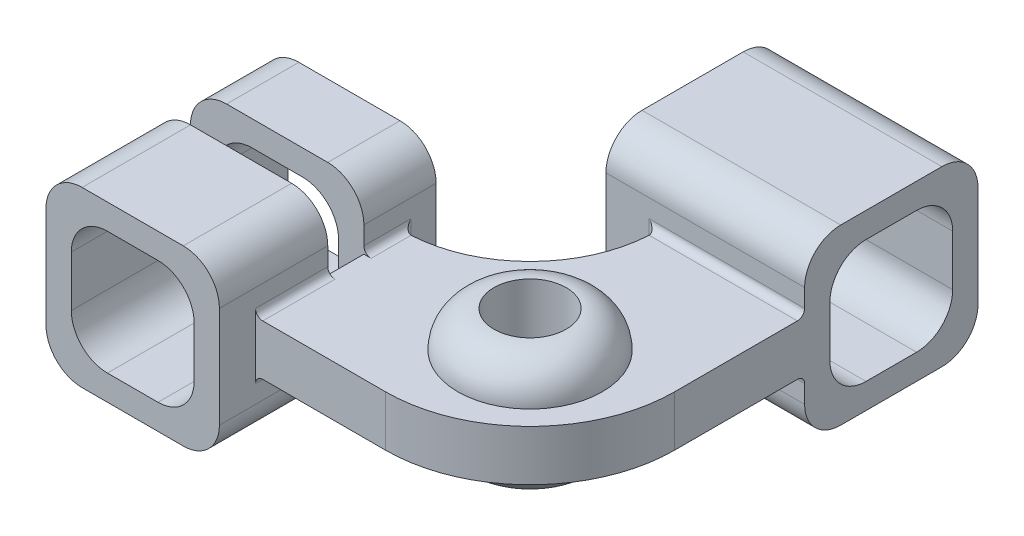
ISO-10303-21;
HEADER;
FILE_DESCRIPTION(('STEP AP214'),'2;1');
FILE_NAME('part.step','',(''),(''),'','','');
FILE_SCHEMA(('AUTOMOTIVE_DESIGN { 1 0 10303 214 1 1 1 1 }'));
ENDSEC;
DATA;
#1=APPLICATION_CONTEXT('core data for automotive mechanical design processes');
#2=APPLICATION_PROTOCOL_DEFINITION('international standard','automotive_design',2000,#1);
#3=PRODUCT_CONTEXT('',#1,'mechanical');
#4=PRODUCT('Part','Part','',(#3));
#5=PRODUCT_RELATED_PRODUCT_CATEGORY('part','',(#4));
#6=PRODUCT_DEFINITION_FORMATION('','',#4);
#7=PRODUCT_DEFINITION_CONTEXT('part definition',#1,'design');
#8=PRODUCT_DEFINITION('design','',#6,#7);
#9=PRODUCT_DEFINITION_SHAPE('','',#8);
#10=(LENGTH_UNIT() NAMED_UNIT(*) SI_UNIT(.MILLI.,.METRE.));
#11=(NAMED_UNIT(*) PLANE_ANGLE_UNIT() SI_UNIT($,.RADIAN.));
#12=(NAMED_UNIT(*) SI_UNIT($,.STERADIAN.) SOLID_ANGLE_UNIT());
#13=UNCERTAINTY_MEASURE_WITH_UNIT(LENGTH_MEASURE(1.E-05),#10,'distance_accuracy_value','');
#14=(GEOMETRIC_REPRESENTATION_CONTEXT(3) GLOBAL_UNCERTAINTY_ASSIGNED_CONTEXT((#13)) GLOBAL_UNIT_ASSIGNED_CONTEXT((#10,
#11,#12)) REPRESENTATION_CONTEXT('',''));
#15=CARTESIAN_POINT('',(0.,0.,0.));
#16=DIRECTION('',(0.,0.,1.));
#17=DIRECTION('',(1.,0.,0.));
#18=AXIS2_PLACEMENT_3D('',#15,#16,#17);
#19=CARTESIAN_POINT('',(0.,24.,10.));
#20=DIRECTION('',(-1.,0.,0.));
#21=DIRECTION('',(0.,0.,1.));
#22=AXIS2_PLACEMENT_3D('',#19,#20,#21);
#23=PLANE('',#22);
#24=DIRECTION('',(0.,1.,0.));
#25=VECTOR('',#24,1.);
#26=CARTESIAN_POINT('',(0.,24.,-43.0606618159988));
#27=LINE('',#26,#25);
#28=CARTESIAN_POINT('',(0.,9.,-43.0606618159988));
#29=VERTEX_POINT('',#28);
#30=CARTESIAN_POINT('',(0.,-9.,-43.0606618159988));
#31=VERTEX_POINT('',#30);
#32=EDGE_CURVE('E849',#29,#31,#27,.F.);
#33=ORIENTED_EDGE('',*,*,#32,.T.);
#34=DIRECTION('',(0.,0.,1.));
#35=VECTOR('',#34,1.);
#36=CARTESIAN_POINT('',(0.,-9.,-30.));
#37=LINE('',#36,#35);
#38=CARTESIAN_POINT('',(0.,-9.,-30.));
#39=VERTEX_POINT('',#38);
#40=EDGE_CURVE('E850',#31,#39,#37,.T.);
#41=ORIENTED_EDGE('',*,*,#40,.T.);
#42=DIRECTION('',(0.,-1.,0.));
#43=VECTOR('',#42,1.);
#44=CARTESIAN_POINT('',(0.,24.,-30.));
#45=LINE('',#44,#43);
#46=CARTESIAN_POINT('',(0.,-14.,-30.));
#47=VERTEX_POINT('',#46);
#48=EDGE_CURVE('E1188',#39,#47,#45,.T.);
#49=ORIENTED_EDGE('',*,*,#48,.T.);
#50=DIRECTION('',(0.,0.,-1.));
#51=VECTOR('',#50,1.);
#52=CARTESIAN_POINT('',(0.,-14.,10.));
#53=LINE('',#52,#51);
#54=CARTESIAN_POINT('',(0.,-14.,-50.));
#55=VERTEX_POINT('',#54);
#56=EDGE_CURVE('E763',#47,#55,#53,.T.);
#57=ORIENTED_EDGE('',*,*,#56,.T.);
#58=DIRECTION('',(0.,1.,0.));
#59=VECTOR('',#58,1.);
#60=CARTESIAN_POINT('',(0.,24.,-50.));
#61=LINE('',#60,#59);
#62=CARTESIAN_POINT('',(0.,14.,-50.));
#63=VERTEX_POINT('',#62);
#64=EDGE_CURVE('E540',#55,#63,#61,.T.);
#65=ORIENTED_EDGE('',*,*,#64,.T.);
#66=DIRECTION('',(0.,0.,-1.));
#67=VECTOR('',#66,1.);
#68=CARTESIAN_POINT('',(0.,14.,10.));
#69=LINE('',#68,#67);
#70=CARTESIAN_POINT('',(0.,14.,-30.));
#71=VERTEX_POINT('',#70);
#72=EDGE_CURVE('E766',#63,#71,#69,.F.);
#73=ORIENTED_EDGE('',*,*,#72,.T.);
#74=CARTESIAN_POINT('',(0.,9.,-30.));
#75=VERTEX_POINT('',#74);
#76=EDGE_CURVE('E488',#71,#75,#45,.T.);
#77=ORIENTED_EDGE('',*,*,#76,.T.);
#78=DIRECTION('',(0.,0.,1.));
#79=VECTOR('',#78,1.);
#80=CARTESIAN_POINT('',(0.,9.,10.));
#81=LINE('',#80,#79);
#82=EDGE_CURVE('E847',#75,#29,#81,.F.);
#83=ORIENTED_EDGE('',*,*,#82,.T.);
#84=EDGE_LOOP('',(#33,#41,#49,#57,#65,#73,#77,#83));
#85=FACE_BOUND('',#84,.T.);
#86=ADVANCED_FACE('F41',(#85),#23,.F.);
#87=DIRECTION('',(0.,1.,0.));
#88=VECTOR('',#87,1.);
#89=CARTESIAN_POINT('',(0.,24.,-20.));
#90=LINE('',#89,#88);
#91=CARTESIAN_POINT('',(0.,-14.,-20.));
#92=VERTEX_POINT('',#91);
#93=CARTESIAN_POINT('',(0.,-9.00000000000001,-20.));
#94=VERTEX_POINT('',#93);
#95=EDGE_CURVE('E483',#92,#94,#90,.T.);
#96=ORIENTED_EDGE('',*,*,#95,.T.);
#97=DIRECTION('',(0.,0.,1.));
#98=VECTOR('',#97,1.);
#99=CARTESIAN_POINT('',(0.,-9.,0.));
#100=LINE('',#99,#98);
#101=CARTESIAN_POINT('',(0.,-9.,0.));
#102=VERTEX_POINT('',#101);
#103=EDGE_CURVE('E872',#94,#102,#100,.T.);
#104=ORIENTED_EDGE('',*,*,#103,.T.);
#105=DIRECTION('',(0.,1.,0.));
#106=VECTOR('',#105,1.);
#107=CARTESIAN_POINT('',(0.,-7.,0.));
#108=LINE('',#107,#106);
#109=CARTESIAN_POINT('',(0.,9.,0.));
#110=VERTEX_POINT('',#109);
#111=EDGE_CURVE('E1213',#102,#110,#108,.T.);
#112=ORIENTED_EDGE('',*,*,#111,.T.);
#113=DIRECTION('',(0.,0.,1.));
#114=VECTOR('',#113,1.);
#115=CARTESIAN_POINT('',(0.,9.,10.));
#116=LINE('',#115,#114);
#117=CARTESIAN_POINT('',(0.,9.,-20.));
#118=VERTEX_POINT('',#117);
#119=EDGE_CURVE('E870',#110,#118,#116,.F.);
#120=ORIENTED_EDGE('',*,*,#119,.T.);
#121=CARTESIAN_POINT('',(0.,14.,-20.));
#122=VERTEX_POINT('',#121);
#123=EDGE_CURVE('E484',#118,#122,#90,.T.);
#124=ORIENTED_EDGE('',*,*,#123,.T.);
#125=DIRECTION('',(0.,0.,-1.));
#126=VECTOR('',#125,1.);
#127=CARTESIAN_POINT('',(0.,14.,10.));
#128=LINE('',#127,#126);
#129=CARTESIAN_POINT('',(0.,14.,10.));
#130=VERTEX_POINT('',#129);
#131=EDGE_CURVE('E740',#122,#130,#128,.F.);
#132=ORIENTED_EDGE('',*,*,#131,.T.);
#133=DIRECTION('',(0.,1.,0.));
#134=VECTOR('',#133,1.);
#135=CARTESIAN_POINT('',(0.,24.,10.));
#136=LINE('',#135,#134);
#137=CARTESIAN_POINT('',(0.,-14.,10.));
#138=VERTEX_POINT('',#137);
#139=EDGE_CURVE('E563',#138,#130,#136,.T.);
#140=ORIENTED_EDGE('',*,*,#139,.F.);
#141=DIRECTION('',(0.,0.,-1.));
#142=VECTOR('',#141,1.);
#143=CARTESIAN_POINT('',(0.,-14.,10.));
#144=LINE('',#143,#142);
#145=EDGE_CURVE('E737',#138,#92,#144,.T.);
#146=ORIENTED_EDGE('',*,*,#145,.T.);
#147=EDGE_LOOP('',(#96,#104,#112,#120,#124,#132,#140,#146));
#148=FACE_BOUND('',#147,.T.);
#149=ADVANCED_FACE('F970',(#148),#23,.F.);
#150=CARTESIAN_POINT('',(-48.,24.,10.));
#151=DIRECTION('',(1.,0.,0.));
#152=DIRECTION('',(0.,0.,-1.));
#153=AXIS2_PLACEMENT_3D('',#150,#151,#152);
#154=PLANE('',#153);
#155=DIRECTION('',(0.,-1.,0.));
#156=VECTOR('',#155,1.);
#157=CARTESIAN_POINT('',(-48.,24.,-50.));
#158=LINE('',#157,#156);
#159=CARTESIAN_POINT('',(-48.,14.,-50.));
#160=VERTEX_POINT('',#159);
#161=CARTESIAN_POINT('',(-48.,-14.,-50.));
#162=VERTEX_POINT('',#161);
#163=EDGE_CURVE('E534',#160,#162,#158,.T.);
#164=ORIENTED_EDGE('',*,*,#163,.T.);
#165=DIRECTION('',(0.,0.,-1.));
#166=VECTOR('',#165,1.);
#167=CARTESIAN_POINT('',(-48.,-14.,10.));
#168=LINE('',#167,#166);
#169=CARTESIAN_POINT('',(-48.,-14.,-30.));
#170=VERTEX_POINT('',#169);
#171=EDGE_CURVE('E785',#162,#170,#168,.F.);
#172=ORIENTED_EDGE('',*,*,#171,.T.);
#173=DIRECTION('',(0.,-1.,0.));
#174=VECTOR('',#173,1.);
#175=CARTESIAN_POINT('',(-48.,24.,-30.));
#176=LINE('',#175,#174);
#177=CARTESIAN_POINT('',(-48.,14.,-30.));
#178=VERTEX_POINT('',#177);
#179=EDGE_CURVE('E487',#178,#170,#176,.T.);
#180=ORIENTED_EDGE('',*,*,#179,.F.);
#181=DIRECTION('',(0.,0.,-1.));
#182=VECTOR('',#181,1.);
#183=CARTESIAN_POINT('',(-48.,14.,10.));
#184=LINE('',#183,#182);
#185=EDGE_CURVE('E782',#178,#160,#184,.T.);
#186=ORIENTED_EDGE('',*,*,#185,.T.);
#187=EDGE_LOOP('',(#164,#172,#180,#186));
#188=FACE_BOUND('',#187,.T.);
#189=ADVANCED_FACE('F975',(#188),#154,.F.);
#190=DIRECTION('',(0.,-1.,0.));
#191=VECTOR('',#190,1.);
#192=CARTESIAN_POINT('',(-48.,24.,10.));
#193=LINE('',#192,#191);
#194=CARTESIAN_POINT('',(-48.,14.,10.));
#195=VERTEX_POINT('',#194);
#196=CARTESIAN_POINT('',(-48.,-14.,10.));
#197=VERTEX_POINT('',#196);
#198=EDGE_CURVE('E558',#195,#197,#193,.T.);
#199=ORIENTED_EDGE('',*,*,#198,.F.);
#200=DIRECTION('',(0.,0.,-1.));
#201=VECTOR('',#200,1.);
#202=CARTESIAN_POINT('',(-48.,14.,10.));
#203=LINE('',#202,#201);
#204=CARTESIAN_POINT('',(-48.,14.,-20.));
#205=VERTEX_POINT('',#204);
#206=EDGE_CURVE('E789',#195,#205,#203,.T.);
#207=ORIENTED_EDGE('',*,*,#206,.T.);
#208=DIRECTION('',(0.,1.,0.));
#209=VECTOR('',#208,1.);
#210=CARTESIAN_POINT('',(-48.,24.,-20.));
#211=LINE('',#210,#209);
#212=CARTESIAN_POINT('',(-48.,-14.,-20.));
#213=VERTEX_POINT('',#212);
#214=EDGE_CURVE('E496',#213,#205,#211,.T.);
#215=ORIENTED_EDGE('',*,*,#214,.F.);
#216=DIRECTION('',(0.,0.,-1.));
#217=VECTOR('',#216,1.);
#218=CARTESIAN_POINT('',(-48.,-14.,10.));
#219=LINE('',#218,#217);
#220=EDGE_CURVE('E787',#213,#197,#219,.F.);
#221=ORIENTED_EDGE('',*,*,#220,.T.);
#222=EDGE_LOOP('',(#199,#207,#215,#221));
#223=FACE_BOUND('',#222,.T.);
#224=ADVANCED_FACE('F985',(#223),#154,.F.);
#225=CARTESIAN_POINT('',(-48.,-24.,10.));
#226=DIRECTION('',(0.,1.,0.));
#227=DIRECTION('',(-1.,0.,0.));
#228=AXIS2_PLACEMENT_3D('',#225,#226,#227);
#229=PLANE('',#228);
#230=DIRECTION('',(1.,0.,0.));
#231=VECTOR('',#230,1.);
#232=CARTESIAN_POINT('',(-48.,-24.,-30.));
#233=LINE('',#232,#231);
#234=CARTESIAN_POINT('',(-38.,-24.,-30.));
#235=VERTEX_POINT('',#234);
#236=CARTESIAN_POINT('',(-9.99999999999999,-24.,-30.));
#237=VERTEX_POINT('',#236);
#238=EDGE_CURVE('E501',#235,#237,#233,.T.);
#239=ORIENTED_EDGE('',*,*,#238,.F.);
#240=DIRECTION('',(0.,0.,-1.));
#241=VECTOR('',#240,1.);
#242=CARTESIAN_POINT('',(-38.,-24.,10.));
#243=LINE('',#242,#241);
#244=CARTESIAN_POINT('',(-38.,-24.,-50.));
#245=VERTEX_POINT('',#244);
#246=EDGE_CURVE('E779',#235,#245,#243,.T.);
#247=ORIENTED_EDGE('',*,*,#246,.T.);
#248=DIRECTION('',(1.,0.,0.));
#249=VECTOR('',#248,1.);
#250=CARTESIAN_POINT('',(-48.,-24.,-50.));
#251=LINE('',#250,#249);
#252=CARTESIAN_POINT('',(-9.99999999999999,-24.,-50.));
#253=VERTEX_POINT('',#252);
#254=EDGE_CURVE('E537',#245,#253,#251,.T.);
#255=ORIENTED_EDGE('',*,*,#254,.T.);
#256=DIRECTION('',(0.,0.,-1.));
#257=VECTOR('',#256,1.);
#258=CARTESIAN_POINT('',(-9.99999999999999,-24.,10.));
#259=LINE('',#258,#257);
#260=EDGE_CURVE('E777',#253,#237,#259,.F.);
#261=ORIENTED_EDGE('',*,*,#260,.T.);
#262=EDGE_LOOP('',(#239,#247,#255,#261));
#263=FACE_BOUND('',#262,.T.);
#264=ADVANCED_FACE('F981',(#263),#229,.F.);
#265=DIRECTION('',(1.,0.,0.));
#266=VECTOR('',#265,1.);
#267=CARTESIAN_POINT('',(-48.,-24.,10.));
#268=LINE('',#267,#266);
#269=CARTESIAN_POINT('',(-38.,-24.,10.));
#270=VERTEX_POINT('',#269);
#271=CARTESIAN_POINT('',(-9.99999999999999,-24.,10.));
#272=VERTEX_POINT('',#271);
#273=EDGE_CURVE('E561',#270,#272,#268,.T.);
#274=ORIENTED_EDGE('',*,*,#273,.F.);
#275=DIRECTION('',(0.,0.,-1.));
#276=VECTOR('',#275,1.);
#277=CARTESIAN_POINT('',(-38.,-24.,10.));
#278=LINE('',#277,#276);
#279=CARTESIAN_POINT('',(-38.,-24.,-20.));
#280=VERTEX_POINT('',#279);
#281=EDGE_CURVE('E794',#270,#280,#278,.T.);
#282=ORIENTED_EDGE('',*,*,#281,.T.);
#283=DIRECTION('',(1.,0.,0.));
#284=VECTOR('',#283,1.);
#285=CARTESIAN_POINT('',(-48.,-24.,-20.));
#286=LINE('',#285,#284);
#287=CARTESIAN_POINT('',(-9.99999999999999,-24.,-20.));
#288=VERTEX_POINT('',#287);
#289=EDGE_CURVE('E498',#280,#288,#286,.T.);
#290=ORIENTED_EDGE('',*,*,#289,.T.);
#291=DIRECTION('',(0.,0.,-1.));
#292=VECTOR('',#291,1.);
#293=CARTESIAN_POINT('',(-9.99999999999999,-24.,10.));
#294=LINE('',#293,#292);
#295=EDGE_CURVE('E792',#288,#272,#294,.F.);
#296=ORIENTED_EDGE('',*,*,#295,.T.);
#297=EDGE_LOOP('',(#274,#282,#290,#296));
#298=FACE_BOUND('',#297,.T.);
#299=ADVANCED_FACE('F984',(#298),#229,.F.);
#300=CARTESIAN_POINT('',(-48.,24.,10.));
#301=DIRECTION('',(0.,-1.,0.));
#302=DIRECTION('',(1.,0.,0.));
#303=AXIS2_PLACEMENT_3D('',#300,#301,#302);
#304=PLANE('',#303);
#305=DIRECTION('',(1.,0.,0.));
#306=VECTOR('',#305,1.);
#307=CARTESIAN_POINT('',(-48.,24.,-30.));
#308=LINE('',#307,#306);
#309=CARTESIAN_POINT('',(-38.,24.,-30.));
#310=VERTEX_POINT('',#309);
#311=CARTESIAN_POINT('',(-9.99999999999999,24.,-30.));
#312=VERTEX_POINT('',#311);
#313=EDGE_CURVE('E492',#310,#312,#308,.T.);
#314=ORIENTED_EDGE('',*,*,#313,.T.);
#315=DIRECTION('',(0.,0.,-1.));
#316=VECTOR('',#315,1.);
#317=CARTESIAN_POINT('',(-9.99999999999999,24.,10.));
#318=LINE('',#317,#316);
#319=CARTESIAN_POINT('',(-9.99999999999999,24.,-50.));
#320=VERTEX_POINT('',#319);
#321=EDGE_CURVE('E752',#312,#320,#318,.T.);
#322=ORIENTED_EDGE('',*,*,#321,.T.);
#323=DIRECTION('',(-1.,0.,0.));
#324=VECTOR('',#323,1.);
#325=CARTESIAN_POINT('',(-48.,24.,-50.));
#326=LINE('',#325,#324);
#327=CARTESIAN_POINT('',(-38.,24.,-50.));
#328=VERTEX_POINT('',#327);
#329=EDGE_CURVE('E543',#320,#328,#326,.T.);
#330=ORIENTED_EDGE('',*,*,#329,.T.);
#331=DIRECTION('',(0.,0.,-1.));
#332=VECTOR('',#331,1.);
#333=CARTESIAN_POINT('',(-38.,24.,10.));
#334=LINE('',#333,#332);
#335=EDGE_CURVE('E750',#328,#310,#334,.F.);
#336=ORIENTED_EDGE('',*,*,#335,.T.);
#337=EDGE_LOOP('',(#314,#322,#330,#336));
#338=FACE_BOUND('',#337,.T.);
#339=ADVANCED_FACE('F979',(#338),#304,.F.);
#340=DIRECTION('',(-1.,0.,0.));
#341=VECTOR('',#340,1.);
#342=CARTESIAN_POINT('',(-48.,24.,10.));
#343=LINE('',#342,#341);
#344=CARTESIAN_POINT('',(-9.99999999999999,24.,10.));
#345=VERTEX_POINT('',#344);
#346=CARTESIAN_POINT('',(-38.,24.,10.));
#347=VERTEX_POINT('',#346);
#348=EDGE_CURVE('E568',#345,#347,#343,.T.);
#349=ORIENTED_EDGE('',*,*,#348,.F.);
#350=DIRECTION('',(0.,0.,-1.));
#351=VECTOR('',#350,1.);
#352=CARTESIAN_POINT('',(-9.99999999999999,24.,10.));
#353=LINE('',#352,#351);
#354=CARTESIAN_POINT('',(-9.99999999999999,24.,-20.));
#355=VERTEX_POINT('',#354);
#356=EDGE_CURVE('E725',#345,#355,#353,.T.);
#357=ORIENTED_EDGE('',*,*,#356,.T.);
#358=DIRECTION('',(1.,0.,0.));
#359=VECTOR('',#358,1.);
#360=CARTESIAN_POINT('',(-48.,24.,-20.));
#361=LINE('',#360,#359);
#362=CARTESIAN_POINT('',(-38.,24.,-20.));
#363=VERTEX_POINT('',#362);
#364=EDGE_CURVE('E495',#363,#355,#361,.T.);
#365=ORIENTED_EDGE('',*,*,#364,.F.);
#366=DIRECTION('',(0.,0.,-1.));
#367=VECTOR('',#366,1.);
#368=CARTESIAN_POINT('',(-38.,24.,10.));
#369=LINE('',#368,#367);
#370=EDGE_CURVE('E723',#363,#347,#369,.F.);
#371=ORIENTED_EDGE('',*,*,#370,.T.);
#372=EDGE_LOOP('',(#349,#357,#365,#371));
#373=FACE_BOUND('',#372,.T.);
#374=ADVANCED_FACE('F1309',(#373),#304,.F.);
#375=CARTESIAN_POINT('',(-41.,17.,10.));
#376=DIRECTION('',(1.,0.,0.));
#377=DIRECTION('',(0.,1.,0.));
#378=AXIS2_PLACEMENT_3D('',#375,#376,#377);
#379=PLANE('',#378);
#380=DIRECTION('',(0.,-1.,0.));
#381=VECTOR('',#380,1.);
#382=CARTESIAN_POINT('',(-41.,17.,-30.));
#383=LINE('',#382,#381);
#384=CARTESIAN_POINT('',(-41.,7.,-30.));
#385=VERTEX_POINT('',#384);
#386=CARTESIAN_POINT('',(-41.,-7.00000000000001,-30.));
#387=VERTEX_POINT('',#386);
#388=EDGE_CURVE('E519',#385,#387,#383,.T.);
#389=ORIENTED_EDGE('',*,*,#388,.T.);
#390=DIRECTION('',(0.,0.,-1.));
#391=VECTOR('',#390,1.);
#392=CARTESIAN_POINT('',(-41.,-7.,-50.));
#393=LINE('',#392,#391);
#394=CARTESIAN_POINT('',(-41.,-7.00000000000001,-50.));
#395=VERTEX_POINT('',#394);
#396=EDGE_CURVE('E685',#387,#395,#393,.T.);
#397=ORIENTED_EDGE('',*,*,#396,.T.);
#398=DIRECTION('',(0.,-1.,0.));
#399=VECTOR('',#398,1.);
#400=CARTESIAN_POINT('',(-41.,17.,-50.));
#401=LINE('',#400,#399);
#402=CARTESIAN_POINT('',(-41.,7.,-50.));
#403=VERTEX_POINT('',#402);
#404=EDGE_CURVE('E475',#403,#395,#401,.T.);
#405=ORIENTED_EDGE('',*,*,#404,.F.);
#406=DIRECTION('',(0.,0.,-1.));
#407=VECTOR('',#406,1.);
#408=CARTESIAN_POINT('',(-41.,7.,-30.));
#409=LINE('',#408,#407);
#410=EDGE_CURVE('E683',#403,#385,#409,.F.);
#411=ORIENTED_EDGE('',*,*,#410,.T.);
#412=EDGE_LOOP('',(#389,#397,#405,#411));
#413=FACE_BOUND('',#412,.T.);
#414=ADVANCED_FACE('F1311',(#413),#379,.T.);
#415=DIRECTION('',(0.,-1.,0.));
#416=VECTOR('',#415,1.);
#417=CARTESIAN_POINT('',(-41.,17.,10.));
#418=LINE('',#417,#416);
#419=CARTESIAN_POINT('',(-41.,7.,10.));
#420=VERTEX_POINT('',#419);
#421=CARTESIAN_POINT('',(-41.,-7.00000000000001,10.));
#422=VERTEX_POINT('',#421);
#423=EDGE_CURVE('E546',#420,#422,#418,.T.);
#424=ORIENTED_EDGE('',*,*,#423,.T.);
#425=DIRECTION('',(0.,0.,-1.));
#426=VECTOR('',#425,1.);
#427=CARTESIAN_POINT('',(-41.,-7.,-20.));
#428=LINE('',#427,#426);
#429=CARTESIAN_POINT('',(-41.,-7.,-20.));
#430=VERTEX_POINT('',#429);
#431=EDGE_CURVE('E695',#422,#430,#428,.T.);
#432=ORIENTED_EDGE('',*,*,#431,.T.);
#433=DIRECTION('',(0.,1.,0.));
#434=VECTOR('',#433,1.);
#435=CARTESIAN_POINT('',(-41.,17.,-20.));
#436=LINE('',#435,#434);
#437=CARTESIAN_POINT('',(-41.,7.,-20.));
#438=VERTEX_POINT('',#437);
#439=EDGE_CURVE('E510',#430,#438,#436,.T.);
#440=ORIENTED_EDGE('',*,*,#439,.T.);
#441=DIRECTION('',(0.,0.,-1.));
#442=VECTOR('',#441,1.);
#443=CARTESIAN_POINT('',(-41.,7.,10.));
#444=LINE('',#443,#442);
#445=EDGE_CURVE('E693',#438,#420,#444,.F.);
#446=ORIENTED_EDGE('',*,*,#445,.T.);
#447=EDGE_LOOP('',(#424,#432,#440,#446));
#448=FACE_BOUND('',#447,.T.);
#449=ADVANCED_FACE('F1316',(#448),#379,.T.);
#450=CARTESIAN_POINT('',(-41.,-17.,10.));
#451=DIRECTION('',(0.,1.,0.));
#452=DIRECTION('',(-1.,0.,0.));
#453=AXIS2_PLACEMENT_3D('',#450,#451,#452);
#454=PLANE('',#453);
#455=DIRECTION('',(1.,0.,0.));
#456=VECTOR('',#455,1.);
#457=CARTESIAN_POINT('',(-41.,-17.,-50.));
#458=LINE('',#457,#456);
#459=CARTESIAN_POINT('',(-31.,-17.,-50.));
#460=VERTEX_POINT('',#459);
#461=CARTESIAN_POINT('',(-17.,-17.,-50.));
#462=VERTEX_POINT('',#461);
#463=EDGE_CURVE('E525',#460,#462,#458,.T.);
#464=ORIENTED_EDGE('',*,*,#463,.F.);
#465=DIRECTION('',(0.,0.,-1.));
#466=VECTOR('',#465,1.);
#467=CARTESIAN_POINT('',(-31.,-17.,-30.));
#468=LINE('',#467,#466);
#469=CARTESIAN_POINT('',(-31.,-17.,-30.));
#470=VERTEX_POINT('',#469);
#471=EDGE_CURVE('E691',#460,#470,#468,.F.);
#472=ORIENTED_EDGE('',*,*,#471,.T.);
#473=DIRECTION('',(1.,0.,0.));
#474=VECTOR('',#473,1.);
#475=CARTESIAN_POINT('',(-41.,-17.,-30.));
#476=LINE('',#475,#474);
#477=CARTESIAN_POINT('',(-17.,-17.,-30.));
#478=VERTEX_POINT('',#477);
#479=EDGE_CURVE('E516',#470,#478,#476,.T.);
#480=ORIENTED_EDGE('',*,*,#479,.T.);
#481=DIRECTION('',(0.,0.,-1.));
#482=VECTOR('',#481,1.);
#483=CARTESIAN_POINT('',(-17.,-17.,-50.));
#484=LINE('',#483,#482);
#485=EDGE_CURVE('E688',#478,#462,#484,.T.);
#486=ORIENTED_EDGE('',*,*,#485,.T.);
#487=EDGE_LOOP('',(#464,#472,#480,#486));
#488=FACE_BOUND('',#487,.T.);
#489=ADVANCED_FACE('F1360',(#488),#454,.T.);
#490=DIRECTION('',(-1.,0.,0.));
#491=VECTOR('',#490,1.);
#492=CARTESIAN_POINT('',(-41.,-17.,-20.));
#493=LINE('',#492,#491);
#494=CARTESIAN_POINT('',(-17.,-17.,-20.));
#495=VERTEX_POINT('',#494);
#496=CARTESIAN_POINT('',(-31.,-17.,-20.));
#497=VERTEX_POINT('',#496);
#498=EDGE_CURVE('E507',#495,#497,#493,.T.);
#499=ORIENTED_EDGE('',*,*,#498,.T.);
#500=DIRECTION('',(0.,0.,-1.));
#501=VECTOR('',#500,1.);
#502=CARTESIAN_POINT('',(-31.,-17.,10.));
#503=LINE('',#502,#501);
#504=CARTESIAN_POINT('',(-31.,-17.,10.));
#505=VERTEX_POINT('',#504);
#506=EDGE_CURVE('E701',#497,#505,#503,.F.);
#507=ORIENTED_EDGE('',*,*,#506,.T.);
#508=DIRECTION('',(1.,0.,0.));
#509=VECTOR('',#508,1.);
#510=CARTESIAN_POINT('',(-41.,-17.,10.));
#511=LINE('',#510,#509);
#512=CARTESIAN_POINT('',(-17.,-17.,10.));
#513=VERTEX_POINT('',#512);
#514=EDGE_CURVE('E549',#505,#513,#511,.T.);
#515=ORIENTED_EDGE('',*,*,#514,.T.);
#516=DIRECTION('',(0.,0.,-1.));
#517=VECTOR('',#516,1.);
#518=CARTESIAN_POINT('',(-17.,-17.,-20.));
#519=LINE('',#518,#517);
#520=EDGE_CURVE('E698',#513,#495,#519,.T.);
#521=ORIENTED_EDGE('',*,*,#520,.T.);
#522=EDGE_LOOP('',(#499,#507,#515,#521));
#523=FACE_BOUND('',#522,.T.);
#524=ADVANCED_FACE('F1358',(#523),#454,.T.);
#525=CARTESIAN_POINT('',(-7.,17.,10.));
#526=DIRECTION('',(-1.,0.,0.));
#527=DIRECTION('',(0.,-1.,0.));
#528=AXIS2_PLACEMENT_3D('',#525,#526,#527);
#529=PLANE('',#528);
#530=DIRECTION('',(0.,1.,0.));
#531=VECTOR('',#530,1.);
#532=CARTESIAN_POINT('',(-7.,17.,-30.));
#533=LINE('',#532,#531);
#534=CARTESIAN_POINT('',(-7.,-7.,-30.));
#535=VERTEX_POINT('',#534);
#536=CARTESIAN_POINT('',(-7.,7.,-30.));
#537=VERTEX_POINT('',#536);
#538=EDGE_CURVE('E513',#535,#537,#533,.T.);
#539=ORIENTED_EDGE('',*,*,#538,.T.);
#540=DIRECTION('',(0.,0.,-1.));
#541=VECTOR('',#540,1.);
#542=CARTESIAN_POINT('',(-7.,7.,-50.));
#543=LINE('',#542,#541);
#544=CARTESIAN_POINT('',(-7.,7.,-50.));
#545=VERTEX_POINT('',#544);
#546=EDGE_CURVE('E715',#537,#545,#543,.T.);
#547=ORIENTED_EDGE('',*,*,#546,.T.);
#548=DIRECTION('',(0.,1.,0.));
#549=VECTOR('',#548,1.);
#550=CARTESIAN_POINT('',(-7.,17.,-50.));
#551=LINE('',#550,#549);
#552=CARTESIAN_POINT('',(-7.,-7.,-50.));
#553=VERTEX_POINT('',#552);
#554=EDGE_CURVE('E528',#553,#545,#551,.T.);
#555=ORIENTED_EDGE('',*,*,#554,.F.);
#556=DIRECTION('',(0.,0.,-1.));
#557=VECTOR('',#556,1.);
#558=CARTESIAN_POINT('',(-7.,-7.,-30.));
#559=LINE('',#558,#557);
#560=EDGE_CURVE('E713',#553,#535,#559,.F.);
#561=ORIENTED_EDGE('',*,*,#560,.T.);
#562=EDGE_LOOP('',(#539,#547,#555,#561));
#563=FACE_BOUND('',#562,.T.);
#564=ADVANCED_FACE('F1355',(#563),#529,.T.);
#565=DIRECTION('',(0.,-1.,0.));
#566=VECTOR('',#565,1.);
#567=CARTESIAN_POINT('',(-7.,17.,-20.));
#568=LINE('',#567,#566);
#569=CARTESIAN_POINT('',(-7.,7.,-20.));
#570=VERTEX_POINT('',#569);
#571=CARTESIAN_POINT('',(-7.,-7.,-20.));
#572=VERTEX_POINT('',#571);
#573=EDGE_CURVE('E504',#570,#572,#568,.T.);
#574=ORIENTED_EDGE('',*,*,#573,.T.);
#575=DIRECTION('',(0.,0.,-1.));
#576=VECTOR('',#575,1.);
#577=CARTESIAN_POINT('',(-7.,-7.,10.));
#578=LINE('',#577,#576);
#579=CARTESIAN_POINT('',(-7.,-7.,10.));
#580=VERTEX_POINT('',#579);
#581=EDGE_CURVE('E721',#572,#580,#578,.F.);
#582=ORIENTED_EDGE('',*,*,#581,.T.);
#583=DIRECTION('',(0.,1.,0.));
#584=VECTOR('',#583,1.);
#585=CARTESIAN_POINT('',(-7.,17.,10.));
#586=LINE('',#585,#584);
#587=CARTESIAN_POINT('',(-7.,7.,10.));
#588=VERTEX_POINT('',#587);
#589=EDGE_CURVE('E552',#580,#588,#586,.T.);
#590=ORIENTED_EDGE('',*,*,#589,.T.);
#591=DIRECTION('',(0.,0.,-1.));
#592=VECTOR('',#591,1.);
#593=CARTESIAN_POINT('',(-7.,7.,-20.));
#594=LINE('',#593,#592);
#595=EDGE_CURVE('E718',#588,#570,#594,.T.);
#596=ORIENTED_EDGE('',*,*,#595,.T.);
#597=EDGE_LOOP('',(#574,#582,#590,#596));
#598=FACE_BOUND('',#597,.T.);
#599=ADVANCED_FACE('F1353',(#598),#529,.T.);
#600=CARTESIAN_POINT('',(-41.,17.,10.));
#601=DIRECTION('',(0.,-1.,0.));
#602=DIRECTION('',(0.,0.,-1.));
#603=AXIS2_PLACEMENT_3D('',#600,#601,#602);
#604=PLANE('',#603);
#605=DIRECTION('',(-1.,0.,0.));
#606=VECTOR('',#605,1.);
#607=CARTESIAN_POINT('',(-41.,17.,-30.));
#608=LINE('',#607,#606);
#609=CARTESIAN_POINT('',(-17.,17.,-30.));
#610=VERTEX_POINT('',#609);
#611=CARTESIAN_POINT('',(-31.,17.,-30.));
#612=VERTEX_POINT('',#611);
#613=EDGE_CURVE('E1240',#610,#612,#608,.T.);
#614=ORIENTED_EDGE('',*,*,#613,.T.);
#615=DIRECTION('',(0.,0.,-1.));
#616=VECTOR('',#615,1.);
#617=CARTESIAN_POINT('',(-31.,17.,-50.));
#618=LINE('',#617,#616);
#619=CARTESIAN_POINT('',(-31.,17.,-50.));
#620=VERTEX_POINT('',#619);
#621=EDGE_CURVE('E710',#612,#620,#618,.T.);
#622=ORIENTED_EDGE('',*,*,#621,.T.);
#623=DIRECTION('',(-1.,0.,0.));
#624=VECTOR('',#623,1.);
#625=CARTESIAN_POINT('',(-41.,17.,-50.));
#626=LINE('',#625,#624);
#627=CARTESIAN_POINT('',(-17.,17.,-50.));
#628=VERTEX_POINT('',#627);
#629=EDGE_CURVE('E531',#628,#620,#626,.T.);
#630=ORIENTED_EDGE('',*,*,#629,.F.);
#631=DIRECTION('',(0.,0.,-1.));
#632=VECTOR('',#631,1.);
#633=CARTESIAN_POINT('',(-17.,17.,-30.));
#634=LINE('',#633,#632);
#635=EDGE_CURVE('E708',#628,#610,#634,.F.);
#636=ORIENTED_EDGE('',*,*,#635,.T.);
#637=EDGE_LOOP('',(#614,#622,#630,#636));
#638=FACE_BOUND('',#637,.T.);
#639=ADVANCED_FACE('F1350',(#638),#604,.T.);
#640=DIRECTION('',(-1.,0.,0.));
#641=VECTOR('',#640,1.);
#642=CARTESIAN_POINT('',(-41.,17.,10.));
#643=LINE('',#642,#641);
#644=CARTESIAN_POINT('',(-17.,17.,10.));
#645=VERTEX_POINT('',#644);
#646=CARTESIAN_POINT('',(-31.,17.,10.));
#647=VERTEX_POINT('',#646);
#648=EDGE_CURVE('E555',#645,#647,#643,.T.);
#649=ORIENTED_EDGE('',*,*,#648,.T.);
#650=DIRECTION('',(0.,0.,-1.));
#651=VECTOR('',#650,1.);
#652=CARTESIAN_POINT('',(-31.,17.,-20.));
#653=LINE('',#652,#651);
#654=CARTESIAN_POINT('',(-31.,17.,-20.));
#655=VERTEX_POINT('',#654);
#656=EDGE_CURVE('E705',#647,#655,#653,.T.);
#657=ORIENTED_EDGE('',*,*,#656,.T.);
#658=DIRECTION('',(1.,0.,0.));
#659=VECTOR('',#658,1.);
#660=CARTESIAN_POINT('',(-41.,17.,-20.));
#661=LINE('',#660,#659);
#662=CARTESIAN_POINT('',(-17.,17.,-20.));
#663=VERTEX_POINT('',#662);
#664=EDGE_CURVE('E1237',#655,#663,#661,.T.);
#665=ORIENTED_EDGE('',*,*,#664,.T.);
#666=DIRECTION('',(0.,0.,-1.));
#667=VECTOR('',#666,1.);
#668=CARTESIAN_POINT('',(-17.,17.,10.));
#669=LINE('',#668,#667);
#670=EDGE_CURVE('E703',#663,#645,#669,.F.);
#671=ORIENTED_EDGE('',*,*,#670,.T.);
#672=EDGE_LOOP('',(#649,#657,#665,#671));
#673=FACE_BOUND('',#672,.T.);
#674=ADVANCED_FACE('F1027',(#673),#604,.T.);
#675=CARTESIAN_POINT('',(0.,-7.,-76.));
#676=DIRECTION('',(0.,1.,0.));
#677=DIRECTION('',(0.,0.,1.));
#678=AXIS2_PLACEMENT_3D('',#675,#676,#677);
#679=CYLINDRICAL_SURFACE('',#678,35.);
#680=CARTESIAN_POINT('',(0.,-7.,-76.));
#681=DIRECTION('',(0.,-1.,0.));
#682=DIRECTION('',(0.,0.,1.));
#683=AXIS2_PLACEMENT_3D('',#680,#681,#682);
#684=CIRCLE('',#683,35.);
#685=CARTESIAN_POINT('',(34.9356617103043,-7.,-73.8787878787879));
#686=VERTEX_POINT('',#685);
#687=CARTESIAN_POINT('',(2.12121212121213,-7.,-41.0643382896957));
#688=VERTEX_POINT('',#687);
#689=EDGE_CURVE('E1208',#686,#688,#684,.T.);
#690=ORIENTED_EDGE('',*,*,#689,.T.);
#691=DIRECTION('',(0.,1.,0.));
#692=VECTOR('',#691,1.);
#693=CARTESIAN_POINT('',(2.12121212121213,-7.,-41.0643382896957));
#694=LINE('',#693,#692);
#695=CARTESIAN_POINT('',(2.12121212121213,7.,-41.0643382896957));
#696=VERTEX_POINT('',#695);
#697=EDGE_CURVE('E844',#688,#696,#694,.T.);
#698=ORIENTED_EDGE('',*,*,#697,.T.);
#699=CARTESIAN_POINT('',(0.,7.,-76.));
#700=DIRECTION('',(0.,-1.,0.));
#701=DIRECTION('',(0.,0.,1.));
#702=AXIS2_PLACEMENT_3D('',#699,#700,#701);
#703=CIRCLE('',#702,35.);
#704=CARTESIAN_POINT('',(34.9356617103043,7.,-73.8787878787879));
#705=VERTEX_POINT('',#704);
#706=EDGE_CURVE('E1249',#705,#696,#703,.T.);
#707=ORIENTED_EDGE('',*,*,#706,.F.);
#708=DIRECTION('',(0.,1.,0.));
#709=VECTOR('',#708,1.);
#710=CARTESIAN_POINT('',(34.9356617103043,-7.,-73.8787878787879));
#711=LINE('',#710,#709);
#712=EDGE_CURVE('E842',#705,#686,#711,.F.);
#713=ORIENTED_EDGE('',*,*,#712,.T.);
#714=EDGE_LOOP('',(#690,#698,#707,#713));
#715=FACE_BOUND('',#714,.T.);
#716=ADVANCED_FACE('F1024',(#715),#679,.F.);
#717=CARTESIAN_POINT('',(76.,-7.,0.));
#718=DIRECTION('',(1.,0.,0.));
#719=DIRECTION('',(0.,0.,-1.));
#720=AXIS2_PLACEMENT_3D('',#717,#718,#719);
#721=PLANE('',#720);
#722=DIRECTION('',(0.,0.,-1.));
#723=VECTOR('',#722,1.);
#724=CARTESIAN_POINT('',(76.,-7.,0.));
#725=LINE('',#724,#723);
#726=CARTESIAN_POINT('',(76.,-7.,-40.));
#727=VERTEX_POINT('',#726);
#728=CARTESIAN_POINT('',(76.,-7.,-74.));
#729=VERTEX_POINT('',#728);
#730=EDGE_CURVE('E1214',#727,#729,#725,.T.);
#731=ORIENTED_EDGE('',*,*,#730,.T.);
#732=CARTESIAN_POINT('',(76.,-9.,-74.));
#733=DIRECTION('',(1.,0.,0.));
#734=DIRECTION('',(0.,0.,-1.));
#735=AXIS2_PLACEMENT_3D('',#732,#733,#734);
#736=CIRCLE('',#735,2.);
#737=CARTESIAN_POINT('',(76.,-9.,-76.));
#738=VERTEX_POINT('',#737);
#739=EDGE_CURVE('E902',#729,#738,#736,.F.);
#740=ORIENTED_EDGE('',*,*,#739,.T.);
#741=DIRECTION('',(0.,-1.,0.));
#742=VECTOR('',#741,1.);
#743=CARTESIAN_POINT('',(76.,24.,-76.));
#744=LINE('',#743,#742);
#745=CARTESIAN_POINT('',(76.,-14.,-76.));
#746=VERTEX_POINT('',#745);
#747=EDGE_CURVE('E592',#738,#746,#744,.T.);
#748=ORIENTED_EDGE('',*,*,#747,.T.);
#749=CARTESIAN_POINT('',(76.,-14.,-86.));
#750=DIRECTION('',(1.,0.,0.));
#751=DIRECTION('',(0.,0.,-1.));
#752=AXIS2_PLACEMENT_3D('',#749,#750,#751);
#753=CIRCLE('',#752,10.);
#754=CARTESIAN_POINT('',(76.,-24.,-86.));
#755=VERTEX_POINT('',#754);
#756=EDGE_CURVE('E642',#746,#755,#753,.T.);
#757=ORIENTED_EDGE('',*,*,#756,.T.);
#758=DIRECTION('',(0.,0.,-1.));
#759=VECTOR('',#758,1.);
#760=CARTESIAN_POINT('',(76.,-24.,-76.));
#761=LINE('',#760,#759);
#762=CARTESIAN_POINT('',(76.,-24.,-114.));
#763=VERTEX_POINT('',#762);
#764=EDGE_CURVE('E617',#755,#763,#761,.T.);
#765=ORIENTED_EDGE('',*,*,#764,.T.);
#766=CARTESIAN_POINT('',(76.,-14.,-114.));
#767=DIRECTION('',(1.,0.,0.));
#768=DIRECTION('',(0.,0.,-1.));
#769=AXIS2_PLACEMENT_3D('',#766,#767,#768);
#770=CIRCLE('',#769,10.);
#771=CARTESIAN_POINT('',(76.,-14.,-124.));
#772=VERTEX_POINT('',#771);
#773=EDGE_CURVE('E636',#763,#772,#770,.T.);
#774=ORIENTED_EDGE('',*,*,#773,.T.);
#775=DIRECTION('',(0.,1.,0.));
#776=VECTOR('',#775,1.);
#777=CARTESIAN_POINT('',(76.,24.,-124.));
#778=LINE('',#777,#776);
#779=CARTESIAN_POINT('',(76.,14.,-124.));
#780=VERTEX_POINT('',#779);
#781=EDGE_CURVE('E1256',#772,#780,#778,.T.);
#782=ORIENTED_EDGE('',*,*,#781,.T.);
#783=CARTESIAN_POINT('',(76.,14.,-114.));
#784=DIRECTION('',(1.,0.,0.));
#785=DIRECTION('',(0.,0.,-1.));
#786=AXIS2_PLACEMENT_3D('',#783,#784,#785);
#787=CIRCLE('',#786,10.);
#788=CARTESIAN_POINT('',(76.,24.,-114.));
#789=VERTEX_POINT('',#788);
#790=EDGE_CURVE('E638',#780,#789,#787,.T.);
#791=ORIENTED_EDGE('',*,*,#790,.T.);
#792=DIRECTION('',(0.,0.,1.));
#793=VECTOR('',#792,1.);
#794=CARTESIAN_POINT('',(76.,24.,-76.));
#795=LINE('',#794,#793);
#796=CARTESIAN_POINT('',(76.,24.,-86.));
#797=VERTEX_POINT('',#796);
#798=EDGE_CURVE('E605',#789,#797,#795,.T.);
#799=ORIENTED_EDGE('',*,*,#798,.T.);
#800=CARTESIAN_POINT('',(76.,14.,-86.));
#801=DIRECTION('',(1.,0.,0.));
#802=DIRECTION('',(0.,0.,-1.));
#803=AXIS2_PLACEMENT_3D('',#800,#801,#802);
#804=CIRCLE('',#803,10.);
#805=CARTESIAN_POINT('',(76.,14.,-76.));
#806=VERTEX_POINT('',#805);
#807=EDGE_CURVE('E640',#797,#806,#804,.T.);
#808=ORIENTED_EDGE('',*,*,#807,.T.);
#809=CARTESIAN_POINT('',(76.,9.,-76.));
#810=VERTEX_POINT('',#809);
#811=EDGE_CURVE('E624',#806,#810,#744,.T.);
#812=ORIENTED_EDGE('',*,*,#811,.T.);
#813=CARTESIAN_POINT('',(76.,9.,-74.));
#814=DIRECTION('',(1.,0.,0.));
#815=DIRECTION('',(0.,0.,-1.));
#816=AXIS2_PLACEMENT_3D('',#813,#814,#815);
#817=CIRCLE('',#816,2.);
#818=CARTESIAN_POINT('',(76.,7.,-74.));
#819=VERTEX_POINT('',#818);
#820=EDGE_CURVE('E911',#810,#819,#817,.F.);
#821=ORIENTED_EDGE('',*,*,#820,.T.);
#822=DIRECTION('',(0.,0.,-1.));
#823=VECTOR('',#822,1.);
#824=CARTESIAN_POINT('',(76.,7.,0.));
#825=LINE('',#824,#823);
#826=CARTESIAN_POINT('',(76.,7.,-40.));
#827=VERTEX_POINT('',#826);
#828=EDGE_CURVE('E1251',#827,#819,#825,.T.);
#829=ORIENTED_EDGE('',*,*,#828,.F.);
#830=DIRECTION('',(0.,1.,0.));
#831=VECTOR('',#830,1.);
#832=CARTESIAN_POINT('',(76.,-7.,-40.));
#833=LINE('',#832,#831);
#834=EDGE_CURVE('E1232',#827,#727,#833,.F.);
#835=ORIENTED_EDGE('',*,*,#834,.T.);
#836=EDGE_LOOP('',(#731,#740,#748,#757,#765,#774,#782,#791,#799,#808,#812,#821,#829,#835));
#837=FACE_BOUND('',#836,.T.);
#838=DIRECTION('',(0.,-1.,0.));
#839=VECTOR('',#838,1.);
#840=CARTESIAN_POINT('',(76.,17.,-83.));
#841=LINE('',#840,#839);
#842=CARTESIAN_POINT('',(76.,7.,-83.));
#843=VERTEX_POINT('',#842);
#844=CARTESIAN_POINT('',(76.,-7.,-83.));
#845=VERTEX_POINT('',#844);
#846=EDGE_CURVE('E580',#843,#845,#841,.T.);
#847=ORIENTED_EDGE('',*,*,#846,.F.);
#848=CARTESIAN_POINT('',(76.,7.,-93.));
#849=DIRECTION('',(1.,0.,0.));
#850=DIRECTION('',(0.,0.,-1.));
#851=AXIS2_PLACEMENT_3D('',#848,#849,#850);
#852=CIRCLE('',#851,10.);
#853=CARTESIAN_POINT('',(76.,17.,-93.));
#854=VERTEX_POINT('',#853);
#855=EDGE_CURVE('E49',#843,#854,#852,.F.);
#856=ORIENTED_EDGE('',*,*,#855,.T.);
#857=DIRECTION('',(0.,0.,1.));
#858=VECTOR('',#857,1.);
#859=CARTESIAN_POINT('',(76.,17.,-83.));
#860=LINE('',#859,#858);
#861=CARTESIAN_POINT('',(76.,17.,-107.));
#862=VERTEX_POINT('',#861);
#863=EDGE_CURVE('E584',#862,#854,#860,.T.);
#864=ORIENTED_EDGE('',*,*,#863,.F.);
#865=CARTESIAN_POINT('',(76.,7.,-107.));
#866=DIRECTION('',(1.,0.,0.));
#867=DIRECTION('',(0.,0.,-1.));
#868=AXIS2_PLACEMENT_3D('',#865,#866,#867);
#869=CIRCLE('',#868,10.);
#870=CARTESIAN_POINT('',(76.,7.,-117.));
#871=VERTEX_POINT('',#870);
#872=EDGE_CURVE('E797',#862,#871,#869,.F.);
#873=ORIENTED_EDGE('',*,*,#872,.T.);
#874=DIRECTION('',(0.,1.,0.));
#875=VECTOR('',#874,1.);
#876=CARTESIAN_POINT('',(76.,17.,-117.));
#877=LINE('',#876,#875);
#878=CARTESIAN_POINT('',(76.,-7.,-117.));
#879=VERTEX_POINT('',#878);
#880=EDGE_CURVE('E597',#879,#871,#877,.T.);
#881=ORIENTED_EDGE('',*,*,#880,.F.);
#882=CARTESIAN_POINT('',(76.,-7.,-107.));
#883=DIRECTION('',(1.,0.,0.));
#884=DIRECTION('',(0.,0.,-1.));
#885=AXIS2_PLACEMENT_3D('',#882,#883,#884);
#886=CIRCLE('',#885,10.);
#887=CARTESIAN_POINT('',(76.,-17.,-107.));
#888=VERTEX_POINT('',#887);
#889=EDGE_CURVE('E801',#879,#888,#886,.F.);
#890=ORIENTED_EDGE('',*,*,#889,.T.);
#891=DIRECTION('',(0.,0.,-1.));
#892=VECTOR('',#891,1.);
#893=CARTESIAN_POINT('',(76.,-17.,-83.));
#894=LINE('',#893,#892);
#895=CARTESIAN_POINT('',(76.,-17.,-93.));
#896=VERTEX_POINT('',#895);
#897=EDGE_CURVE('E594',#896,#888,#894,.T.);
#898=ORIENTED_EDGE('',*,*,#897,.F.);
#899=CARTESIAN_POINT('',(76.,-7.,-93.));
#900=DIRECTION('',(1.,0.,0.));
#901=DIRECTION('',(0.,0.,-1.));
#902=AXIS2_PLACEMENT_3D('',#899,#900,#901);
#903=CIRCLE('',#902,10.);
#904=EDGE_CURVE('E805',#896,#845,#903,.F.);
#905=ORIENTED_EDGE('',*,*,#904,.T.);
#906=EDGE_LOOP('',(#847,#856,#864,#873,#881,#890,#898,#905));
#907=FACE_BOUND('',#906,.T.);
#908=ADVANCED_FACE('F934',(#837,#907),#721,.T.);
#909=CARTESIAN_POINT('',(0.,-7.,0.));
#910=DIRECTION('',(0.,0.,1.));
#911=DIRECTION('',(1.,0.,0.));
#912=AXIS2_PLACEMENT_3D('',#909,#910,#911);
#913=PLANE('',#912);
#914=ORIENTED_EDGE('',*,*,#111,.F.);
#915=CARTESIAN_POINT('',(2.00000000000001,-9.,0.));
#916=DIRECTION('',(0.,0.,1.));
#917=DIRECTION('',(1.,0.,0.));
#918=AXIS2_PLACEMENT_3D('',#915,#916,#917);
#919=CIRCLE('',#918,2.);
#920=CARTESIAN_POINT('',(2.00000000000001,-7.,0.));
#921=VERTEX_POINT('',#920);
#922=EDGE_CURVE('E898',#102,#921,#919,.F.);
#923=ORIENTED_EDGE('',*,*,#922,.T.);
#924=DIRECTION('',(1.,0.,0.));
#925=VECTOR('',#924,1.);
#926=CARTESIAN_POINT('',(0.,-7.,0.));
#927=LINE('',#926,#925);
#928=CARTESIAN_POINT('',(36.,-7.,0.));
#929=VERTEX_POINT('',#928);
#930=EDGE_CURVE('E1219',#921,#929,#927,.T.);
#931=ORIENTED_EDGE('',*,*,#930,.T.);
#932=DIRECTION('',(0.,1.,0.));
#933=VECTOR('',#932,1.);
#934=CARTESIAN_POINT('',(36.,-7.,0.));
#935=LINE('',#934,#933);
#936=CARTESIAN_POINT('',(36.,7.,0.));
#937=VERTEX_POINT('',#936);
#938=EDGE_CURVE('E1216',#929,#937,#935,.T.);
#939=ORIENTED_EDGE('',*,*,#938,.T.);
#940=DIRECTION('',(1.,0.,0.));
#941=VECTOR('',#940,1.);
#942=CARTESIAN_POINT('',(0.,7.,0.));
#943=LINE('',#942,#941);
#944=CARTESIAN_POINT('',(2.00000000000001,7.,0.));
#945=VERTEX_POINT('',#944);
#946=EDGE_CURVE('E614',#945,#937,#943,.T.);
#947=ORIENTED_EDGE('',*,*,#946,.F.);
#948=CARTESIAN_POINT('',(2.00000000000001,9.,0.));
#949=DIRECTION('',(0.,0.,1.));
#950=DIRECTION('',(1.,0.,0.));
#951=AXIS2_PLACEMENT_3D('',#948,#949,#950);
#952=CIRCLE('',#951,2.);
#953=EDGE_CURVE('E906',#945,#110,#952,.F.);
#954=ORIENTED_EDGE('',*,*,#953,.T.);
#955=EDGE_LOOP('',(#914,#923,#931,#939,#947,#954));
#956=FACE_BOUND('',#955,.T.);
#957=ADVANCED_FACE('F1022',(#956),#913,.T.);
#958=CARTESIAN_POINT('',(0.,-7.,-76.));
#959=DIRECTION('',(0.,1.,0.));
#960=DIRECTION('',(0.,0.,1.));
#961=AXIS2_PLACEMENT_3D('',#958,#959,#960);
#962=PLANE('',#961);
#963=CARTESIAN_POINT('',(46.,-7.,-30.));
#964=DIRECTION('',(0.,1.,0.));
#965=DIRECTION('',(0.,0.,1.));
#966=AXIS2_PLACEMENT_3D('',#963,#964,#965);
#967=CIRCLE('',#966,20.);
#968=CARTESIAN_POINT('',(46.,-7.,-9.99999999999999));
#969=VERTEX_POINT('',#968);
#970=EDGE_CURVE('E1243',#969,#969,#967,.F.);
#971=ORIENTED_EDGE('',*,*,#970,.F.);
#972=EDGE_LOOP('',(#971));
#973=FACE_BOUND('',#972,.T.);
#974=DIRECTION('',(0.,0.,1.));
#975=VECTOR('',#974,1.);
#976=CARTESIAN_POINT('',(0.,-7.,-76.));
#977=LINE('',#976,#975);
#978=CARTESIAN_POINT('',(0.,-7.,-30.));
#979=VERTEX_POINT('',#978);
#980=CARTESIAN_POINT('',(0.,-7.,-20.));
#981=VERTEX_POINT('',#980);
#982=EDGE_CURVE('E458',#979,#981,#977,.T.);
#983=ORIENTED_EDGE('',*,*,#982,.F.);
#984=DIRECTION('',(1.,0.,0.));
#985=VECTOR('',#984,1.);
#986=CARTESIAN_POINT('',(0.,-7.,-30.));
#987=LINE('',#986,#985);
#988=CARTESIAN_POINT('',(2.00000000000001,-7.,-30.));
#989=VERTEX_POINT('',#988);
#990=EDGE_CURVE('E868',#979,#989,#987,.T.);
#991=ORIENTED_EDGE('',*,*,#990,.T.);
#992=DIRECTION('',(0.,0.,1.));
#993=VECTOR('',#992,1.);
#994=CARTESIAN_POINT('',(2.00000000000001,-7.,-41.));
#995=LINE('',#994,#993);
#996=CARTESIAN_POINT('',(2.00000000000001,-7.,-41.0606618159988));
#997=VERTEX_POINT('',#996);
#998=EDGE_CURVE('E866',#989,#997,#995,.F.);
#999=ORIENTED_EDGE('',*,*,#998,.T.);
#1000=CARTESIAN_POINT('',(2.00000000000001,-7.,-43.0606618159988));
#1001=DIRECTION('',(0.,1.,0.));
#1002=DIRECTION('',(0.,0.,1.));
#1003=AXIS2_PLACEMENT_3D('',#1000,#1001,#1002);
#1004=CIRCLE('',#1003,2.);
#1005=EDGE_CURVE('E889',#997,#688,#1004,.T.);
#1006=ORIENTED_EDGE('',*,*,#1005,.T.);
#1007=ORIENTED_EDGE('',*,*,#689,.F.);
#1008=CARTESIAN_POINT('',(32.9393381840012,-7.,-74.));
#1009=DIRECTION('',(0.,1.,0.));
#1010=DIRECTION('',(0.,0.,1.));
#1011=AXIS2_PLACEMENT_3D('',#1008,#1009,#1010);
#1012=CIRCLE('',#1011,2.);
#1013=CARTESIAN_POINT('',(34.9393381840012,-7.,-74.));
#1014=VERTEX_POINT('',#1013);
#1015=EDGE_CURVE('E893',#686,#1014,#1012,.T.);
#1016=ORIENTED_EDGE('',*,*,#1015,.T.);
#1017=DIRECTION('',(-1.,0.,0.));
#1018=VECTOR('',#1017,1.);
#1019=CARTESIAN_POINT('',(0.,-7.,-74.));
#1020=LINE('',#1019,#1018);
#1021=EDGE_CURVE('E466',#1014,#729,#1020,.F.);
#1022=ORIENTED_EDGE('',*,*,#1021,.T.);
#1023=ORIENTED_EDGE('',*,*,#730,.F.);
#1024=CARTESIAN_POINT('',(36.,-7.,-40.));
#1025=DIRECTION('',(0.,1.,0.));
#1026=DIRECTION('',(0.,0.,1.));
#1027=AXIS2_PLACEMENT_3D('',#1024,#1025,#1026);
#1028=CIRCLE('',#1027,40.);
#1029=EDGE_CURVE('E1234',#727,#929,#1028,.F.);
#1030=ORIENTED_EDGE('',*,*,#1029,.T.);
#1031=ORIENTED_EDGE('',*,*,#930,.F.);
#1032=DIRECTION('',(0.,0.,1.));
#1033=VECTOR('',#1032,1.);
#1034=CARTESIAN_POINT('',(2.00000000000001,-7.,-20.));
#1035=LINE('',#1034,#1033);
#1036=CARTESIAN_POINT('',(2.00000000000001,-7.,-20.));
#1037=VERTEX_POINT('',#1036);
#1038=EDGE_CURVE('E462',#921,#1037,#1035,.F.);
#1039=ORIENTED_EDGE('',*,*,#1038,.T.);
#1040=DIRECTION('',(-1.,0.,0.));
#1041=VECTOR('',#1040,1.);
#1042=CARTESIAN_POINT('',(0.,-7.,-20.));
#1043=LINE('',#1042,#1041);
#1044=EDGE_CURVE('E454',#1037,#981,#1043,.T.);
#1045=ORIENTED_EDGE('',*,*,#1044,.T.);
#1046=EDGE_LOOP('',(#983,#991,#999,#1006,#1007,#1016,#1022,#1023,#1030,#1031,#1039,#1045));
#1047=FACE_BOUND('',#1046,.T.);
#1048=ADVANCED_FACE('F456',(#973,#1047),#962,.F.);
#1049=CARTESIAN_POINT('',(0.,7.,-76.));
#1050=DIRECTION('',(0.,1.,0.));
#1051=DIRECTION('',(0.,0.,1.));
#1052=AXIS2_PLACEMENT_3D('',#1049,#1050,#1051);
#1053=PLANE('',#1052);
#1054=CARTESIAN_POINT('',(46.,7.,-30.));
#1055=DIRECTION('',(0.,1.,0.));
#1056=DIRECTION('',(0.,0.,1.));
#1057=AXIS2_PLACEMENT_3D('',#1054,#1055,#1056);
#1058=CIRCLE('',#1057,20.);
#1059=CARTESIAN_POINT('',(46.,7.,-9.99999999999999));
#1060=VERTEX_POINT('',#1059);
#1061=EDGE_CURVE('E633',#1060,#1060,#1058,.T.);
#1062=ORIENTED_EDGE('',*,*,#1061,.F.);
#1063=EDGE_LOOP('',(#1062));
#1064=FACE_BOUND('',#1063,.T.);
#1065=CARTESIAN_POINT('',(2.00000000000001,7.,-43.0606618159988));
#1066=DIRECTION('',(0.,1.,0.));
#1067=DIRECTION('',(0.,0.,1.));
#1068=AXIS2_PLACEMENT_3D('',#1065,#1066,#1067);
#1069=CIRCLE('',#1068,2.);
#1070=CARTESIAN_POINT('',(2.00000000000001,7.,-41.0606618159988));
#1071=VERTEX_POINT('',#1070);
#1072=EDGE_CURVE('E886',#696,#1071,#1069,.F.);
#1073=ORIENTED_EDGE('',*,*,#1072,.T.);
#1074=DIRECTION('',(0.,0.,1.));
#1075=VECTOR('',#1074,1.);
#1076=CARTESIAN_POINT('',(2.00000000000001,7.,-76.));
#1077=LINE('',#1076,#1075);
#1078=CARTESIAN_POINT('',(2.00000000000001,7.,-30.));
#1079=VERTEX_POINT('',#1078);
#1080=EDGE_CURVE('E883',#1071,#1079,#1077,.T.);
#1081=ORIENTED_EDGE('',*,*,#1080,.T.);
#1082=DIRECTION('',(-1.,0.,0.));
#1083=VECTOR('',#1082,1.);
#1084=CARTESIAN_POINT('',(-48.,7.,-30.));
#1085=LINE('',#1084,#1083);
#1086=CARTESIAN_POINT('',(0.,7.,-30.));
#1087=VERTEX_POINT('',#1086);
#1088=EDGE_CURVE('E881',#1079,#1087,#1085,.T.);
#1089=ORIENTED_EDGE('',*,*,#1088,.T.);
#1090=DIRECTION('',(0.,0.,1.));
#1091=VECTOR('',#1090,1.);
#1092=CARTESIAN_POINT('',(0.,7.,-76.));
#1093=LINE('',#1092,#1091);
#1094=CARTESIAN_POINT('',(0.,7.,-20.));
#1095=VERTEX_POINT('',#1094);
#1096=EDGE_CURVE('E476',#1087,#1095,#1093,.T.);
#1097=ORIENTED_EDGE('',*,*,#1096,.T.);
#1098=DIRECTION('',(1.,0.,0.));
#1099=VECTOR('',#1098,1.);
#1100=CARTESIAN_POINT('',(-48.,7.,-20.));
#1101=LINE('',#1100,#1099);
#1102=CARTESIAN_POINT('',(2.00000000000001,7.,-20.));
#1103=VERTEX_POINT('',#1102);
#1104=EDGE_CURVE('E481',#1095,#1103,#1101,.T.);
#1105=ORIENTED_EDGE('',*,*,#1104,.T.);
#1106=DIRECTION('',(0.,0.,1.));
#1107=VECTOR('',#1106,1.);
#1108=CARTESIAN_POINT('',(2.00000000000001,7.,-76.));
#1109=LINE('',#1108,#1107);
#1110=EDGE_CURVE('E878',#1103,#945,#1109,.T.);
#1111=ORIENTED_EDGE('',*,*,#1110,.T.);
#1112=ORIENTED_EDGE('',*,*,#946,.T.);
#1113=CARTESIAN_POINT('',(36.,7.,-40.));
#1114=DIRECTION('',(0.,1.,0.));
#1115=DIRECTION('',(0.,0.,1.));
#1116=AXIS2_PLACEMENT_3D('',#1113,#1114,#1115);
#1117=CIRCLE('',#1116,40.);
#1118=EDGE_CURVE('E1230',#937,#827,#1117,.T.);
#1119=ORIENTED_EDGE('',*,*,#1118,.T.);
#1120=ORIENTED_EDGE('',*,*,#828,.T.);
#1121=DIRECTION('',(-1.,0.,0.));
#1122=VECTOR('',#1121,1.);
#1123=CARTESIAN_POINT('',(35.,7.,-74.));
#1124=LINE('',#1123,#1122);
#1125=CARTESIAN_POINT('',(34.9393381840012,7.,-74.));
#1126=VERTEX_POINT('',#1125);
#1127=EDGE_CURVE('E875',#819,#1126,#1124,.T.);
#1128=ORIENTED_EDGE('',*,*,#1127,.T.);
#1129=CARTESIAN_POINT('',(32.9393381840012,7.,-74.));
#1130=DIRECTION('',(0.,1.,0.));
#1131=DIRECTION('',(0.,0.,1.));
#1132=AXIS2_PLACEMENT_3D('',#1129,#1130,#1131);
#1133=CIRCLE('',#1132,2.);
#1134=EDGE_CURVE('E891',#1126,#705,#1133,.F.);
#1135=ORIENTED_EDGE('',*,*,#1134,.T.);
#1136=ORIENTED_EDGE('',*,*,#706,.T.);
#1137=EDGE_LOOP('',(#1073,#1081,#1089,#1097,#1105,#1111,#1112,#1119,#1120,#1128,#1135,#1136));
#1138=FACE_BOUND('',#1137,.T.);
#1139=ADVANCED_FACE('F1016',(#1064,#1138),#1053,.T.);
#1140=CARTESIAN_POINT('',(21.,24.,-76.));
#1141=DIRECTION('',(0.,0.,1.));
#1142=DIRECTION('',(1.,0.,0.));
#1143=AXIS2_PLACEMENT_3D('',#1140,#1141,#1142);
#1144=PLANE('',#1143);
#1145=ORIENTED_EDGE('',*,*,#747,.F.);
#1146=DIRECTION('',(-1.,0.,0.));
#1147=VECTOR('',#1146,1.);
#1148=CARTESIAN_POINT('',(21.,-9.,-76.));
#1149=LINE('',#1148,#1147);
#1150=CARTESIAN_POINT('',(32.9393381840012,-9.,-76.));
#1151=VERTEX_POINT('',#1150);
#1152=EDGE_CURVE('E860',#738,#1151,#1149,.T.);
#1153=ORIENTED_EDGE('',*,*,#1152,.T.);
#1154=DIRECTION('',(0.,-1.,0.));
#1155=VECTOR('',#1154,1.);
#1156=CARTESIAN_POINT('',(32.9393381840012,7.,-76.));
#1157=LINE('',#1156,#1155);
#1158=CARTESIAN_POINT('',(32.9393381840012,9.,-76.));
#1159=VERTEX_POINT('',#1158);
#1160=EDGE_CURVE('E855',#1151,#1159,#1157,.F.);
#1161=ORIENTED_EDGE('',*,*,#1160,.T.);
#1162=DIRECTION('',(-1.,0.,0.));
#1163=VECTOR('',#1162,1.);
#1164=CARTESIAN_POINT('',(76.,9.,-76.));
#1165=LINE('',#1164,#1163);
#1166=EDGE_CURVE('E851',#1159,#810,#1165,.F.);
#1167=ORIENTED_EDGE('',*,*,#1166,.T.);
#1168=ORIENTED_EDGE('',*,*,#811,.F.);
#1169=DIRECTION('',(1.,0.,0.));
#1170=VECTOR('',#1169,1.);
#1171=CARTESIAN_POINT('',(21.,14.,-76.));
#1172=LINE('',#1171,#1170);
#1173=CARTESIAN_POINT('',(21.,14.,-76.));
#1174=VERTEX_POINT('',#1173);
#1175=EDGE_CURVE('E630',#806,#1174,#1172,.F.);
#1176=ORIENTED_EDGE('',*,*,#1175,.T.);
#1177=DIRECTION('',(0.,-1.,0.));
#1178=VECTOR('',#1177,1.);
#1179=CARTESIAN_POINT('',(21.,24.,-76.));
#1180=LINE('',#1179,#1178);
#1181=CARTESIAN_POINT('',(21.,-14.,-76.));
#1182=VERTEX_POINT('',#1181);
#1183=EDGE_CURVE('E601',#1174,#1182,#1180,.T.);
#1184=ORIENTED_EDGE('',*,*,#1183,.T.);
#1185=DIRECTION('',(1.,0.,0.));
#1186=VECTOR('',#1185,1.);
#1187=CARTESIAN_POINT('',(21.,-14.,-76.));
#1188=LINE('',#1187,#1186);
#1189=EDGE_CURVE('E632',#1182,#746,#1188,.T.);
#1190=ORIENTED_EDGE('',*,*,#1189,.T.);
#1191=EDGE_LOOP('',(#1145,#1153,#1161,#1167,#1168,#1176,#1184,#1190));
#1192=FACE_BOUND('',#1191,.T.);
#1193=ADVANCED_FACE('F1006',(#1192),#1144,.T.);
#1194=CARTESIAN_POINT('',(21.,24.,-76.));
#1195=DIRECTION('',(0.,1.,0.));
#1196=DIRECTION('',(0.,0.,1.));
#1197=AXIS2_PLACEMENT_3D('',#1194,#1195,#1196);
#1198=PLANE('',#1197);
#1199=DIRECTION('',(0.,0.,1.));
#1200=VECTOR('',#1199,1.);
#1201=CARTESIAN_POINT('',(21.,24.,-76.));
#1202=LINE('',#1201,#1200);
#1203=CARTESIAN_POINT('',(21.,24.,-114.));
#1204=VERTEX_POINT('',#1203);
#1205=CARTESIAN_POINT('',(21.,24.,-86.));
#1206=VERTEX_POINT('',#1205);
#1207=EDGE_CURVE('E611',#1204,#1206,#1202,.T.);
#1208=ORIENTED_EDGE('',*,*,#1207,.T.);
#1209=DIRECTION('',(1.,0.,0.));
#1210=VECTOR('',#1209,1.);
#1211=CARTESIAN_POINT('',(21.,24.,-86.));
#1212=LINE('',#1211,#1210);
#1213=EDGE_CURVE('E672',#1206,#797,#1212,.T.);
#1214=ORIENTED_EDGE('',*,*,#1213,.T.);
#1215=ORIENTED_EDGE('',*,*,#798,.F.);
#1216=DIRECTION('',(1.,0.,0.));
#1217=VECTOR('',#1216,1.);
#1218=CARTESIAN_POINT('',(21.,24.,-114.));
#1219=LINE('',#1218,#1217);
#1220=EDGE_CURVE('E670',#789,#1204,#1219,.F.);
#1221=ORIENTED_EDGE('',*,*,#1220,.T.);
#1222=EDGE_LOOP('',(#1208,#1214,#1215,#1221));
#1223=FACE_BOUND('',#1222,.T.);
#1224=ADVANCED_FACE('F1002',(#1223),#1198,.T.);
#1225=CARTESIAN_POINT('',(21.,24.,-124.));
#1226=DIRECTION('',(0.,0.,-1.));
#1227=DIRECTION('',(-1.,0.,0.));
#1228=AXIS2_PLACEMENT_3D('',#1225,#1226,#1227);
#1229=PLANE('',#1228);
#1230=DIRECTION('',(0.,1.,0.));
#1231=VECTOR('',#1230,1.);
#1232=CARTESIAN_POINT('',(21.,24.,-124.));
#1233=LINE('',#1232,#1231);
#1234=CARTESIAN_POINT('',(21.,-14.,-124.));
#1235=VERTEX_POINT('',#1234);
#1236=CARTESIAN_POINT('',(21.,14.,-124.));
#1237=VERTEX_POINT('',#1236);
#1238=EDGE_CURVE('E608',#1235,#1237,#1233,.T.);
#1239=ORIENTED_EDGE('',*,*,#1238,.T.);
#1240=DIRECTION('',(1.,0.,0.));
#1241=VECTOR('',#1240,1.);
#1242=CARTESIAN_POINT('',(21.,14.,-124.));
#1243=LINE('',#1242,#1241);
#1244=EDGE_CURVE('E680',#1237,#780,#1243,.T.);
#1245=ORIENTED_EDGE('',*,*,#1244,.T.);
#1246=ORIENTED_EDGE('',*,*,#781,.F.);
#1247=DIRECTION('',(1.,0.,0.));
#1248=VECTOR('',#1247,1.);
#1249=CARTESIAN_POINT('',(21.,-14.,-124.));
#1250=LINE('',#1249,#1248);
#1251=EDGE_CURVE('E678',#772,#1235,#1250,.F.);
#1252=ORIENTED_EDGE('',*,*,#1251,.T.);
#1253=EDGE_LOOP('',(#1239,#1245,#1246,#1252));
#1254=FACE_BOUND('',#1253,.T.);
#1255=ADVANCED_FACE('F1005',(#1254),#1229,.T.);
#1256=CARTESIAN_POINT('',(21.,-24.,-76.));
#1257=DIRECTION('',(0.,-1.,0.));
#1258=DIRECTION('',(0.,0.,-1.));
#1259=AXIS2_PLACEMENT_3D('',#1256,#1257,#1258);
#1260=PLANE('',#1259);
#1261=ORIENTED_EDGE('',*,*,#764,.F.);
#1262=DIRECTION('',(1.,0.,0.));
#1263=VECTOR('',#1262,1.);
#1264=CARTESIAN_POINT('',(21.,-24.,-86.));
#1265=LINE('',#1264,#1263);
#1266=CARTESIAN_POINT('',(21.,-24.,-86.));
#1267=VERTEX_POINT('',#1266);
#1268=EDGE_CURVE('E647',#755,#1267,#1265,.F.);
#1269=ORIENTED_EDGE('',*,*,#1268,.T.);
#1270=DIRECTION('',(0.,0.,-1.));
#1271=VECTOR('',#1270,1.);
#1272=CARTESIAN_POINT('',(21.,-24.,-76.));
#1273=LINE('',#1272,#1271);
#1274=CARTESIAN_POINT('',(21.,-24.,-114.));
#1275=VERTEX_POINT('',#1274);
#1276=EDGE_CURVE('E604',#1267,#1275,#1273,.T.);
#1277=ORIENTED_EDGE('',*,*,#1276,.T.);
#1278=DIRECTION('',(1.,0.,0.));
#1279=VECTOR('',#1278,1.);
#1280=CARTESIAN_POINT('',(21.,-24.,-114.));
#1281=LINE('',#1280,#1279);
#1282=EDGE_CURVE('E644',#1275,#763,#1281,.T.);
#1283=ORIENTED_EDGE('',*,*,#1282,.T.);
#1284=EDGE_LOOP('',(#1261,#1269,#1277,#1283));
#1285=FACE_BOUND('',#1284,.T.);
#1286=ADVANCED_FACE('F1001',(#1285),#1260,.T.);
#1287=CARTESIAN_POINT('',(21.,0.,0.));
#1288=DIRECTION('',(1.,0.,0.));
#1289=DIRECTION('',(0.,0.,-1.));
#1290=AXIS2_PLACEMENT_3D('',#1287,#1288,#1289);
#1291=PLANE('',#1290);
#1292=DIRECTION('',(0.,1.,0.));
#1293=VECTOR('',#1292,1.);
#1294=CARTESIAN_POINT('',(21.,17.,-117.));
#1295=LINE('',#1294,#1293);
#1296=CARTESIAN_POINT('',(21.,-7.,-117.));
#1297=VERTEX_POINT('',#1296);
#1298=CARTESIAN_POINT('',(21.,7.,-117.));
#1299=VERTEX_POINT('',#1298);
#1300=EDGE_CURVE('E587',#1297,#1299,#1295,.T.);
#1301=ORIENTED_EDGE('',*,*,#1300,.T.);
#1302=CARTESIAN_POINT('',(21.,7.,-107.));
#1303=DIRECTION('',(1.,0.,0.));
#1304=DIRECTION('',(0.,0.,-1.));
#1305=AXIS2_PLACEMENT_3D('',#1302,#1303,#1304);
#1306=CIRCLE('',#1305,10.);
#1307=CARTESIAN_POINT('',(21.,17.,-107.));
#1308=VERTEX_POINT('',#1307);
#1309=EDGE_CURVE('E799',#1299,#1308,#1306,.T.);
#1310=ORIENTED_EDGE('',*,*,#1309,.T.);
#1311=DIRECTION('',(0.,0.,1.));
#1312=VECTOR('',#1311,1.);
#1313=CARTESIAN_POINT('',(21.,17.,-83.));
#1314=LINE('',#1313,#1312);
#1315=CARTESIAN_POINT('',(21.,17.,-93.));
#1316=VERTEX_POINT('',#1315);
#1317=EDGE_CURVE('E590',#1308,#1316,#1314,.T.);
#1318=ORIENTED_EDGE('',*,*,#1317,.T.);
#1319=CARTESIAN_POINT('',(21.,7.,-93.));
#1320=DIRECTION('',(1.,0.,0.));
#1321=DIRECTION('',(0.,0.,-1.));
#1322=AXIS2_PLACEMENT_3D('',#1319,#1320,#1321);
#1323=CIRCLE('',#1322,10.);
#1324=CARTESIAN_POINT('',(21.,7.,-83.));
#1325=VERTEX_POINT('',#1324);
#1326=EDGE_CURVE('E12',#1316,#1325,#1323,.T.);
#1327=ORIENTED_EDGE('',*,*,#1326,.T.);
#1328=DIRECTION('',(0.,-1.,0.));
#1329=VECTOR('',#1328,1.);
#1330=CARTESIAN_POINT('',(21.,17.,-83.));
#1331=LINE('',#1330,#1329);
#1332=CARTESIAN_POINT('',(21.,-7.,-83.));
#1333=VERTEX_POINT('',#1332);
#1334=EDGE_CURVE('E581',#1325,#1333,#1331,.T.);
#1335=ORIENTED_EDGE('',*,*,#1334,.T.);
#1336=CARTESIAN_POINT('',(21.,-7.,-93.));
#1337=DIRECTION('',(1.,0.,0.));
#1338=DIRECTION('',(0.,0.,-1.));
#1339=AXIS2_PLACEMENT_3D('',#1336,#1337,#1338);
#1340=CIRCLE('',#1339,10.);
#1341=CARTESIAN_POINT('',(21.,-17.,-93.));
#1342=VERTEX_POINT('',#1341);
#1343=EDGE_CURVE('E808',#1333,#1342,#1340,.T.);
#1344=ORIENTED_EDGE('',*,*,#1343,.T.);
#1345=DIRECTION('',(0.,0.,-1.));
#1346=VECTOR('',#1345,1.);
#1347=CARTESIAN_POINT('',(21.,-17.,-83.));
#1348=LINE('',#1347,#1346);
#1349=CARTESIAN_POINT('',(21.,-17.,-107.));
#1350=VERTEX_POINT('',#1349);
#1351=EDGE_CURVE('E583',#1342,#1350,#1348,.T.);
#1352=ORIENTED_EDGE('',*,*,#1351,.T.);
#1353=CARTESIAN_POINT('',(21.,-7.,-107.));
#1354=DIRECTION('',(1.,0.,0.));
#1355=DIRECTION('',(0.,0.,-1.));
#1356=AXIS2_PLACEMENT_3D('',#1353,#1354,#1355);
#1357=CIRCLE('',#1356,10.);
#1358=EDGE_CURVE('E803',#1350,#1297,#1357,.T.);
#1359=ORIENTED_EDGE('',*,*,#1358,.T.);
#1360=EDGE_LOOP('',(#1301,#1310,#1318,#1327,#1335,#1344,#1352,#1359));
#1361=FACE_BOUND('',#1360,.T.);
#1362=ORIENTED_EDGE('',*,*,#1276,.F.);
#1363=CARTESIAN_POINT('',(21.,-14.,-86.));
#1364=DIRECTION('',(1.,0.,0.));
#1365=DIRECTION('',(0.,0.,-1.));
#1366=AXIS2_PLACEMENT_3D('',#1363,#1364,#1365);
#1367=CIRCLE('',#1366,10.);
#1368=EDGE_CURVE('E655',#1267,#1182,#1367,.F.);
#1369=ORIENTED_EDGE('',*,*,#1368,.T.);
#1370=ORIENTED_EDGE('',*,*,#1183,.F.);
#1371=CARTESIAN_POINT('',(21.,14.,-86.));
#1372=DIRECTION('',(1.,0.,0.));
#1373=DIRECTION('',(0.,0.,-1.));
#1374=AXIS2_PLACEMENT_3D('',#1371,#1372,#1373);
#1375=CIRCLE('',#1374,10.);
#1376=EDGE_CURVE('E653',#1174,#1206,#1375,.F.);
#1377=ORIENTED_EDGE('',*,*,#1376,.T.);
#1378=ORIENTED_EDGE('',*,*,#1207,.F.);
#1379=CARTESIAN_POINT('',(21.,14.,-114.));
#1380=DIRECTION('',(1.,0.,0.));
#1381=DIRECTION('',(0.,0.,-1.));
#1382=AXIS2_PLACEMENT_3D('',#1379,#1380,#1381);
#1383=CIRCLE('',#1382,10.);
#1384=EDGE_CURVE('E651',#1204,#1237,#1383,.F.);
#1385=ORIENTED_EDGE('',*,*,#1384,.T.);
#1386=ORIENTED_EDGE('',*,*,#1238,.F.);
#1387=CARTESIAN_POINT('',(21.,-14.,-114.));
#1388=DIRECTION('',(1.,0.,0.));
#1389=DIRECTION('',(0.,0.,-1.));
#1390=AXIS2_PLACEMENT_3D('',#1387,#1388,#1389);
#1391=CIRCLE('',#1390,10.);
#1392=EDGE_CURVE('E649',#1235,#1275,#1391,.F.);
#1393=ORIENTED_EDGE('',*,*,#1392,.T.);
#1394=EDGE_LOOP('',(#1362,#1369,#1370,#1377,#1378,#1385,#1386,#1393));
#1395=FACE_BOUND('',#1394,.T.);
#1396=ADVANCED_FACE('F943',(#1361,#1395),#1291,.F.);
#1397=CARTESIAN_POINT('',(21.,17.,-83.));
#1398=DIRECTION('',(0.,0.,1.));
#1399=DIRECTION('',(1.,0.,0.));
#1400=AXIS2_PLACEMENT_3D('',#1397,#1398,#1399);
#1401=PLANE('',#1400);
#1402=ORIENTED_EDGE('',*,*,#1334,.F.);
#1403=DIRECTION('',(1.,0.,0.));
#1404=VECTOR('',#1403,1.);
#1405=CARTESIAN_POINT('',(76.,7.,-83.));
#1406=LINE('',#1405,#1404);
#1407=EDGE_CURVE('E913',#1325,#843,#1406,.T.);
#1408=ORIENTED_EDGE('',*,*,#1407,.T.);
#1409=ORIENTED_EDGE('',*,*,#846,.T.);
#1410=DIRECTION('',(1.,0.,0.));
#1411=VECTOR('',#1410,1.);
#1412=CARTESIAN_POINT('',(21.,-7.,-83.));
#1413=LINE('',#1412,#1411);
#1414=EDGE_CURVE('E675',#845,#1333,#1413,.F.);
#1415=ORIENTED_EDGE('',*,*,#1414,.T.);
#1416=EDGE_LOOP('',(#1402,#1408,#1409,#1415));
#1417=FACE_BOUND('',#1416,.T.);
#1418=ADVANCED_FACE('F931',(#1417),#1401,.F.);
#1419=CARTESIAN_POINT('',(21.,17.,-83.));
#1420=DIRECTION('',(0.,1.,0.));
#1421=DIRECTION('',(0.,0.,1.));
#1422=AXIS2_PLACEMENT_3D('',#1419,#1420,#1421);
#1423=PLANE('',#1422);
#1424=ORIENTED_EDGE('',*,*,#863,.T.);
#1425=DIRECTION('',(1.,0.,0.));
#1426=VECTOR('',#1425,1.);
#1427=CARTESIAN_POINT('',(21.,17.,-93.));
#1428=LINE('',#1427,#1426);
#1429=EDGE_CURVE('E62',#854,#1316,#1428,.F.);
#1430=ORIENTED_EDGE('',*,*,#1429,.T.);
#1431=ORIENTED_EDGE('',*,*,#1317,.F.);
#1432=DIRECTION('',(1.,0.,0.));
#1433=VECTOR('',#1432,1.);
#1434=CARTESIAN_POINT('',(76.,17.,-107.));
#1435=LINE('',#1434,#1433);
#1436=EDGE_CURVE('E657',#1308,#862,#1435,.T.);
#1437=ORIENTED_EDGE('',*,*,#1436,.T.);
#1438=EDGE_LOOP('',(#1424,#1430,#1431,#1437));
#1439=FACE_BOUND('',#1438,.T.);
#1440=ADVANCED_FACE('F961',(#1439),#1423,.F.);
#1441=CARTESIAN_POINT('',(21.,17.,-117.));
#1442=DIRECTION('',(0.,0.,-1.));
#1443=DIRECTION('',(-1.,0.,0.));
#1444=AXIS2_PLACEMENT_3D('',#1441,#1442,#1443);
#1445=PLANE('',#1444);
#1446=ORIENTED_EDGE('',*,*,#880,.T.);
#1447=DIRECTION('',(1.,0.,0.));
#1448=VECTOR('',#1447,1.);
#1449=CARTESIAN_POINT('',(21.,7.,-117.));
#1450=LINE('',#1449,#1448);
#1451=EDGE_CURVE('E663',#871,#1299,#1450,.F.);
#1452=ORIENTED_EDGE('',*,*,#1451,.T.);
#1453=ORIENTED_EDGE('',*,*,#1300,.F.);
#1454=DIRECTION('',(1.,0.,0.));
#1455=VECTOR('',#1454,1.);
#1456=CARTESIAN_POINT('',(76.,-7.,-117.));
#1457=LINE('',#1456,#1455);
#1458=EDGE_CURVE('E660',#1297,#879,#1457,.T.);
#1459=ORIENTED_EDGE('',*,*,#1458,.T.);
#1460=EDGE_LOOP('',(#1446,#1452,#1453,#1459));
#1461=FACE_BOUND('',#1460,.T.);
#1462=ADVANCED_FACE('F955',(#1461),#1445,.F.);
#1463=CARTESIAN_POINT('',(21.,-17.,-83.));
#1464=DIRECTION('',(0.,-1.,0.));
#1465=DIRECTION('',(0.,0.,-1.));
#1466=AXIS2_PLACEMENT_3D('',#1463,#1464,#1465);
#1467=PLANE('',#1466);
#1468=ORIENTED_EDGE('',*,*,#897,.T.);
#1469=DIRECTION('',(1.,0.,0.));
#1470=VECTOR('',#1469,1.);
#1471=CARTESIAN_POINT('',(21.,-17.,-107.));
#1472=LINE('',#1471,#1470);
#1473=EDGE_CURVE('E668',#888,#1350,#1472,.F.);
#1474=ORIENTED_EDGE('',*,*,#1473,.T.);
#1475=ORIENTED_EDGE('',*,*,#1351,.F.);
#1476=DIRECTION('',(1.,0.,0.));
#1477=VECTOR('',#1476,1.);
#1478=CARTESIAN_POINT('',(76.,-17.,-93.));
#1479=LINE('',#1478,#1477);
#1480=EDGE_CURVE('E665',#1342,#896,#1479,.T.);
#1481=ORIENTED_EDGE('',*,*,#1480,.T.);
#1482=EDGE_LOOP('',(#1468,#1474,#1475,#1481));
#1483=FACE_BOUND('',#1482,.T.);
#1484=ADVANCED_FACE('F947',(#1483),#1467,.F.);
#1485=CARTESIAN_POINT('',(0.,0.,10.));
#1486=DIRECTION('',(0.,0.,1.));
#1487=DIRECTION('',(1.,0.,0.));
#1488=AXIS2_PLACEMENT_3D('',#1485,#1486,#1487);
#1489=PLANE('',#1488);
#1490=ORIENTED_EDGE('',*,*,#139,.T.);
#1491=CARTESIAN_POINT('',(-9.99999999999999,14.,10.));
#1492=DIRECTION('',(0.,0.,1.));
#1493=DIRECTION('',(1.,0.,0.));
#1494=AXIS2_PLACEMENT_3D('',#1491,#1492,#1493);
#1495=CIRCLE('',#1494,10.);
#1496=EDGE_CURVE('E748',#130,#345,#1495,.T.);
#1497=ORIENTED_EDGE('',*,*,#1496,.T.);
#1498=ORIENTED_EDGE('',*,*,#348,.T.);
#1499=CARTESIAN_POINT('',(-38.,14.,10.));
#1500=DIRECTION('',(0.,0.,1.));
#1501=DIRECTION('',(1.,0.,0.));
#1502=AXIS2_PLACEMENT_3D('',#1499,#1500,#1501);
#1503=CIRCLE('',#1502,10.);
#1504=EDGE_CURVE('E746',#347,#195,#1503,.T.);
#1505=ORIENTED_EDGE('',*,*,#1504,.T.);
#1506=ORIENTED_EDGE('',*,*,#198,.T.);
#1507=CARTESIAN_POINT('',(-38.,-14.,10.));
#1508=DIRECTION('',(0.,0.,1.));
#1509=DIRECTION('',(1.,0.,0.));
#1510=AXIS2_PLACEMENT_3D('',#1507,#1508,#1509);
#1511=CIRCLE('',#1510,10.);
#1512=EDGE_CURVE('E744',#197,#270,#1511,.T.);
#1513=ORIENTED_EDGE('',*,*,#1512,.T.);
#1514=ORIENTED_EDGE('',*,*,#273,.T.);
#1515=CARTESIAN_POINT('',(-9.99999999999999,-14.,10.));
#1516=DIRECTION('',(0.,0.,1.));
#1517=DIRECTION('',(1.,0.,0.));
#1518=AXIS2_PLACEMENT_3D('',#1515,#1516,#1517);
#1519=CIRCLE('',#1518,10.);
#1520=EDGE_CURVE('E742',#272,#138,#1519,.T.);
#1521=ORIENTED_EDGE('',*,*,#1520,.T.);
#1522=EDGE_LOOP('',(#1490,#1497,#1498,#1505,#1506,#1513,#1514,#1521));
#1523=FACE_BOUND('',#1522,.T.);
#1524=ORIENTED_EDGE('',*,*,#514,.F.);
#1525=CARTESIAN_POINT('',(-31.,-7.,10.));
#1526=DIRECTION('',(0.,0.,1.));
#1527=DIRECTION('',(1.,0.,0.));
#1528=AXIS2_PLACEMENT_3D('',#1525,#1526,#1527);
#1529=CIRCLE('',#1528,10.);
#1530=EDGE_CURVE('E816',#505,#422,#1529,.F.);
#1531=ORIENTED_EDGE('',*,*,#1530,.T.);
#1532=ORIENTED_EDGE('',*,*,#423,.F.);
#1533=CARTESIAN_POINT('',(-31.,7.,10.));
#1534=DIRECTION('',(0.,0.,1.));
#1535=DIRECTION('',(1.,0.,0.));
#1536=AXIS2_PLACEMENT_3D('',#1533,#1534,#1535);
#1537=CIRCLE('',#1536,10.);
#1538=EDGE_CURVE('E820',#420,#647,#1537,.F.);
#1539=ORIENTED_EDGE('',*,*,#1538,.T.);
#1540=ORIENTED_EDGE('',*,*,#648,.F.);
#1541=CARTESIAN_POINT('',(-17.,7.,10.));
#1542=DIRECTION('',(0.,0.,1.));
#1543=DIRECTION('',(1.,0.,0.));
#1544=AXIS2_PLACEMENT_3D('',#1541,#1542,#1543);
#1545=CIRCLE('',#1544,10.);
#1546=EDGE_CURVE('E840',#645,#588,#1545,.F.);
#1547=ORIENTED_EDGE('',*,*,#1546,.T.);
#1548=ORIENTED_EDGE('',*,*,#589,.F.);
#1549=CARTESIAN_POINT('',(-17.,-7.,10.));
#1550=DIRECTION('',(0.,0.,1.));
#1551=DIRECTION('',(1.,0.,0.));
#1552=AXIS2_PLACEMENT_3D('',#1549,#1550,#1551);
#1553=CIRCLE('',#1552,10.);
#1554=EDGE_CURVE('E832',#580,#513,#1553,.F.);
#1555=ORIENTED_EDGE('',*,*,#1554,.T.);
#1556=EDGE_LOOP('',(#1524,#1531,#1532,#1539,#1540,#1547,#1548,#1555));
#1557=FACE_BOUND('',#1556,.T.);
#1558=ADVANCED_FACE('F996',(#1523,#1557),#1489,.T.);
#1559=CARTESIAN_POINT('',(0.,0.,-50.));
#1560=DIRECTION('',(0.,0.,1.));
#1561=DIRECTION('',(1.,0.,0.));
#1562=AXIS2_PLACEMENT_3D('',#1559,#1560,#1561);
#1563=PLANE('',#1562);
#1564=ORIENTED_EDGE('',*,*,#554,.T.);
#1565=CARTESIAN_POINT('',(-17.,7.,-50.));
#1566=DIRECTION('',(0.,0.,1.));
#1567=DIRECTION('',(1.,0.,0.));
#1568=AXIS2_PLACEMENT_3D('',#1565,#1566,#1567);
#1569=CIRCLE('',#1568,10.);
#1570=EDGE_CURVE('E826',#545,#628,#1569,.T.);
#1571=ORIENTED_EDGE('',*,*,#1570,.T.);
#1572=ORIENTED_EDGE('',*,*,#629,.T.);
#1573=CARTESIAN_POINT('',(-31.,7.,-50.));
#1574=DIRECTION('',(0.,0.,1.));
#1575=DIRECTION('',(1.,0.,0.));
#1576=AXIS2_PLACEMENT_3D('',#1573,#1574,#1575);
#1577=CIRCLE('',#1576,10.);
#1578=EDGE_CURVE('E822',#620,#403,#1577,.T.);
#1579=ORIENTED_EDGE('',*,*,#1578,.T.);
#1580=ORIENTED_EDGE('',*,*,#404,.T.);
#1581=CARTESIAN_POINT('',(-31.,-7.,-50.));
#1582=DIRECTION('',(0.,0.,1.));
#1583=DIRECTION('',(1.,0.,0.));
#1584=AXIS2_PLACEMENT_3D('',#1581,#1582,#1583);
#1585=CIRCLE('',#1584,10.);
#1586=EDGE_CURVE('E810',#395,#460,#1585,.T.);
#1587=ORIENTED_EDGE('',*,*,#1586,.T.);
#1588=ORIENTED_EDGE('',*,*,#463,.T.);
#1589=CARTESIAN_POINT('',(-17.,-7.,-50.));
#1590=DIRECTION('',(0.,0.,1.));
#1591=DIRECTION('',(1.,0.,0.));
#1592=AXIS2_PLACEMENT_3D('',#1589,#1590,#1591);
#1593=CIRCLE('',#1592,10.);
#1594=EDGE_CURVE('E834',#462,#553,#1593,.T.);
#1595=ORIENTED_EDGE('',*,*,#1594,.T.);
#1596=EDGE_LOOP('',(#1564,#1571,#1572,#1579,#1580,#1587,#1588,#1595));
#1597=FACE_BOUND('',#1596,.T.);
#1598=ORIENTED_EDGE('',*,*,#329,.F.);
#1599=CARTESIAN_POINT('',(-9.99999999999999,14.,-50.));
#1600=DIRECTION('',(0.,0.,1.));
#1601=DIRECTION('',(1.,0.,0.));
#1602=AXIS2_PLACEMENT_3D('',#1599,#1600,#1601);
#1603=CIRCLE('',#1602,10.);
#1604=EDGE_CURVE('E761',#320,#63,#1603,.F.);
#1605=ORIENTED_EDGE('',*,*,#1604,.T.);
#1606=ORIENTED_EDGE('',*,*,#64,.F.);
#1607=CARTESIAN_POINT('',(-9.99999999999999,-14.,-50.));
#1608=DIRECTION('',(0.,0.,1.));
#1609=DIRECTION('',(1.,0.,0.));
#1610=AXIS2_PLACEMENT_3D('',#1607,#1608,#1609);
#1611=CIRCLE('',#1610,10.);
#1612=EDGE_CURVE('E755',#55,#253,#1611,.F.);
#1613=ORIENTED_EDGE('',*,*,#1612,.T.);
#1614=ORIENTED_EDGE('',*,*,#254,.F.);
#1615=CARTESIAN_POINT('',(-38.,-14.,-50.));
#1616=DIRECTION('',(0.,0.,1.));
#1617=DIRECTION('',(1.,0.,0.));
#1618=AXIS2_PLACEMENT_3D('',#1615,#1616,#1617);
#1619=CIRCLE('',#1618,10.);
#1620=EDGE_CURVE('E759',#245,#162,#1619,.F.);
#1621=ORIENTED_EDGE('',*,*,#1620,.T.);
#1622=ORIENTED_EDGE('',*,*,#163,.F.);
#1623=CARTESIAN_POINT('',(-38.,14.,-50.));
#1624=DIRECTION('',(0.,0.,1.));
#1625=DIRECTION('',(1.,0.,0.));
#1626=AXIS2_PLACEMENT_3D('',#1623,#1624,#1625);
#1627=CIRCLE('',#1626,10.);
#1628=EDGE_CURVE('E757',#160,#328,#1627,.F.);
#1629=ORIENTED_EDGE('',*,*,#1628,.T.);
#1630=EDGE_LOOP('',(#1598,#1605,#1606,#1613,#1614,#1621,#1622,#1629));
#1631=FACE_BOUND('',#1630,.T.);
#1632=ADVANCED_FACE('F1038',(#1597,#1631),#1563,.F.);
#1633=CARTESIAN_POINT('',(36.,-7.,-40.));
#1634=DIRECTION('',(0.,1.,0.));
#1635=DIRECTION('',(0.,0.,1.));
#1636=AXIS2_PLACEMENT_3D('',#1633,#1634,#1635);
#1637=CYLINDRICAL_SURFACE('',#1636,40.);
#1638=ORIENTED_EDGE('',*,*,#1029,.F.);
#1639=ORIENTED_EDGE('',*,*,#834,.F.);
#1640=ORIENTED_EDGE('',*,*,#1118,.F.);
#1641=ORIENTED_EDGE('',*,*,#938,.F.);
#1642=EDGE_LOOP('',(#1638,#1639,#1640,#1641));
#1643=FACE_BOUND('',#1642,.T.);
#1644=ADVANCED_FACE('F1035',(#1643),#1637,.T.);
#1645=CARTESIAN_POINT('',(0.,0.,0.));
#1646=DIRECTION('',(-1.,0.,0.));
#1647=DIRECTION('',(0.,0.,1.));
#1648=AXIS2_PLACEMENT_3D('',#1645,#1646,#1647);
#1649=PLANE('',#1648);
#1650=ORIENTED_EDGE('',*,*,#982,.T.);
#1651=EDGE_CURVE('E472',#981,#1095,#90,.T.);
#1652=ORIENTED_EDGE('',*,*,#1651,.T.);
#1653=ORIENTED_EDGE('',*,*,#1096,.F.);
#1654=EDGE_CURVE('E474',#1087,#979,#45,.T.);
#1655=ORIENTED_EDGE('',*,*,#1654,.T.);
#1656=EDGE_LOOP('',(#1650,#1652,#1653,#1655));
#1657=FACE_BOUND('',#1656,.T.);
#1658=ADVANCED_FACE('F470',(#1657),#1649,.T.);
#1659=CARTESIAN_POINT('',(-48.,24.,-30.));
#1660=DIRECTION('',(0.,0.,1.));
#1661=DIRECTION('',(0.,-1.,0.));
#1662=AXIS2_PLACEMENT_3D('',#1659,#1660,#1661);
#1663=PLANE('',#1662);
#1664=ORIENTED_EDGE('',*,*,#613,.F.);
#1665=CARTESIAN_POINT('',(-17.,7.,-30.));
#1666=DIRECTION('',(0.,0.,1.));
#1667=DIRECTION('',(0.,-1.,0.));
#1668=AXIS2_PLACEMENT_3D('',#1665,#1666,#1667);
#1669=CIRCLE('',#1668,10.);
#1670=EDGE_CURVE('E828',#610,#537,#1669,.F.);
#1671=ORIENTED_EDGE('',*,*,#1670,.T.);
#1672=ORIENTED_EDGE('',*,*,#538,.F.);
#1673=CARTESIAN_POINT('',(-17.,-7.,-30.));
#1674=DIRECTION('',(0.,0.,1.));
#1675=DIRECTION('',(0.,-1.,0.));
#1676=AXIS2_PLACEMENT_3D('',#1673,#1674,#1675);
#1677=CIRCLE('',#1676,10.);
#1678=EDGE_CURVE('E836',#535,#478,#1677,.F.);
#1679=ORIENTED_EDGE('',*,*,#1678,.T.);
#1680=ORIENTED_EDGE('',*,*,#479,.F.);
#1681=CARTESIAN_POINT('',(-31.,-7.,-30.));
#1682=DIRECTION('',(0.,0.,1.));
#1683=DIRECTION('',(0.,-1.,0.));
#1684=AXIS2_PLACEMENT_3D('',#1681,#1682,#1683);
#1685=CIRCLE('',#1684,10.);
#1686=EDGE_CURVE('E812',#470,#387,#1685,.F.);
#1687=ORIENTED_EDGE('',*,*,#1686,.T.);
#1688=ORIENTED_EDGE('',*,*,#388,.F.);
#1689=CARTESIAN_POINT('',(-31.,7.,-30.));
#1690=DIRECTION('',(0.,0.,1.));
#1691=DIRECTION('',(0.,-1.,0.));
#1692=AXIS2_PLACEMENT_3D('',#1689,#1690,#1691);
#1693=CIRCLE('',#1692,10.);
#1694=EDGE_CURVE('E824',#385,#612,#1693,.F.);
#1695=ORIENTED_EDGE('',*,*,#1694,.T.);
#1696=EDGE_LOOP('',(#1664,#1671,#1672,#1679,#1680,#1687,#1688,#1695));
#1697=FACE_BOUND('',#1696,.T.);
#1698=ORIENTED_EDGE('',*,*,#76,.F.);
#1699=CARTESIAN_POINT('',(-9.99999999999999,14.,-30.));
#1700=DIRECTION('',(0.,0.,1.));
#1701=DIRECTION('',(0.,-1.,0.));
#1702=AXIS2_PLACEMENT_3D('',#1699,#1700,#1701);
#1703=CIRCLE('',#1702,10.);
#1704=EDGE_CURVE('E775',#71,#312,#1703,.T.);
#1705=ORIENTED_EDGE('',*,*,#1704,.T.);
#1706=ORIENTED_EDGE('',*,*,#313,.F.);
#1707=CARTESIAN_POINT('',(-38.,14.,-30.));
#1708=DIRECTION('',(0.,0.,1.));
#1709=DIRECTION('',(0.,-1.,0.));
#1710=AXIS2_PLACEMENT_3D('',#1707,#1708,#1709);
#1711=CIRCLE('',#1710,10.);
#1712=EDGE_CURVE('E771',#310,#178,#1711,.T.);
#1713=ORIENTED_EDGE('',*,*,#1712,.T.);
#1714=ORIENTED_EDGE('',*,*,#179,.T.);
#1715=CARTESIAN_POINT('',(-38.,-14.,-30.));
#1716=DIRECTION('',(0.,0.,1.));
#1717=DIRECTION('',(0.,-1.,0.));
#1718=AXIS2_PLACEMENT_3D('',#1715,#1716,#1717);
#1719=CIRCLE('',#1718,10.);
#1720=EDGE_CURVE('E773',#170,#235,#1719,.T.);
#1721=ORIENTED_EDGE('',*,*,#1720,.T.);
#1722=ORIENTED_EDGE('',*,*,#238,.T.);
#1723=CARTESIAN_POINT('',(-9.99999999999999,-14.,-30.));
#1724=DIRECTION('',(0.,0.,1.));
#1725=DIRECTION('',(0.,-1.,0.));
#1726=AXIS2_PLACEMENT_3D('',#1723,#1724,#1725);
#1727=CIRCLE('',#1726,10.);
#1728=EDGE_CURVE('E768',#237,#47,#1727,.T.);
#1729=ORIENTED_EDGE('',*,*,#1728,.T.);
#1730=ORIENTED_EDGE('',*,*,#48,.F.);
#1731=CARTESIAN_POINT('',(2.00000000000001,-9.,-30.));
#1732=DIRECTION('',(0.,0.,1.));
#1733=DIRECTION('',(0.,-1.,0.));
#1734=AXIS2_PLACEMENT_3D('',#1731,#1732,#1733);
#1735=CIRCLE('',#1734,2.);
#1736=EDGE_CURVE('E896',#39,#989,#1735,.F.);
#1737=ORIENTED_EDGE('',*,*,#1736,.T.);
#1738=ORIENTED_EDGE('',*,*,#990,.F.);
#1739=ORIENTED_EDGE('',*,*,#1654,.F.);
#1740=ORIENTED_EDGE('',*,*,#1088,.F.);
#1741=CARTESIAN_POINT('',(2.00000000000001,9.,-30.));
#1742=DIRECTION('',(0.,0.,1.));
#1743=DIRECTION('',(0.,-1.,0.));
#1744=AXIS2_PLACEMENT_3D('',#1741,#1742,#1743);
#1745=CIRCLE('',#1744,2.);
#1746=EDGE_CURVE('E904',#1079,#75,#1745,.F.);
#1747=ORIENTED_EDGE('',*,*,#1746,.T.);
#1748=EDGE_LOOP('',(#1698,#1705,#1706,#1713,#1714,#1721,#1722,#1729,#1730,#1737,#1738,#1739,
#1740,#1747));
#1749=FACE_BOUND('',#1748,.T.);
#1750=ADVANCED_FACE('F1205',(#1697,#1749),#1663,.T.);
#1751=CARTESIAN_POINT('',(-48.,24.,-20.));
#1752=DIRECTION('',(0.,0.,-1.));
#1753=DIRECTION('',(0.,1.,0.));
#1754=AXIS2_PLACEMENT_3D('',#1751,#1752,#1753);
#1755=PLANE('',#1754);
#1756=ORIENTED_EDGE('',*,*,#498,.F.);
#1757=CARTESIAN_POINT('',(-17.,-7.,-20.));
#1758=DIRECTION('',(0.,0.,-1.));
#1759=DIRECTION('',(0.,1.,0.));
#1760=AXIS2_PLACEMENT_3D('',#1757,#1758,#1759);
#1761=CIRCLE('',#1760,10.);
#1762=EDGE_CURVE('E830',#495,#572,#1761,.F.);
#1763=ORIENTED_EDGE('',*,*,#1762,.T.);
#1764=ORIENTED_EDGE('',*,*,#573,.F.);
#1765=CARTESIAN_POINT('',(-17.,7.,-20.));
#1766=DIRECTION('',(0.,0.,-1.));
#1767=DIRECTION('',(0.,1.,0.));
#1768=AXIS2_PLACEMENT_3D('',#1765,#1766,#1767);
#1769=CIRCLE('',#1768,10.);
#1770=EDGE_CURVE('E838',#570,#663,#1769,.F.);
#1771=ORIENTED_EDGE('',*,*,#1770,.T.);
#1772=ORIENTED_EDGE('',*,*,#664,.F.);
#1773=CARTESIAN_POINT('',(-31.,7.,-20.));
#1774=DIRECTION('',(0.,0.,-1.));
#1775=DIRECTION('',(0.,1.,0.));
#1776=AXIS2_PLACEMENT_3D('',#1773,#1774,#1775);
#1777=CIRCLE('',#1776,10.);
#1778=EDGE_CURVE('E818',#655,#438,#1777,.F.);
#1779=ORIENTED_EDGE('',*,*,#1778,.T.);
#1780=ORIENTED_EDGE('',*,*,#439,.F.);
#1781=CARTESIAN_POINT('',(-31.,-7.,-20.));
#1782=DIRECTION('',(0.,0.,-1.));
#1783=DIRECTION('',(0.,1.,0.));
#1784=AXIS2_PLACEMENT_3D('',#1781,#1782,#1783);
#1785=CIRCLE('',#1784,10.);
#1786=EDGE_CURVE('E814',#430,#497,#1785,.F.);
#1787=ORIENTED_EDGE('',*,*,#1786,.T.);
#1788=EDGE_LOOP('',(#1756,#1763,#1764,#1771,#1772,#1779,#1780,#1787));
#1789=FACE_BOUND('',#1788,.T.);
#1790=ORIENTED_EDGE('',*,*,#364,.T.);
#1791=CARTESIAN_POINT('',(-9.99999999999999,14.,-20.));
#1792=DIRECTION('',(0.,0.,-1.));
#1793=DIRECTION('',(0.,1.,0.));
#1794=AXIS2_PLACEMENT_3D('',#1791,#1792,#1793);
#1795=CIRCLE('',#1794,10.);
#1796=EDGE_CURVE('E734',#355,#122,#1795,.T.);
#1797=ORIENTED_EDGE('',*,*,#1796,.T.);
#1798=ORIENTED_EDGE('',*,*,#123,.F.);
#1799=CARTESIAN_POINT('',(2.00000000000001,9.,-20.));
#1800=DIRECTION('',(0.,0.,-1.));
#1801=DIRECTION('',(0.,1.,0.));
#1802=AXIS2_PLACEMENT_3D('',#1799,#1800,#1801);
#1803=CIRCLE('',#1802,2.);
#1804=EDGE_CURVE('E909',#118,#1103,#1803,.F.);
#1805=ORIENTED_EDGE('',*,*,#1804,.T.);
#1806=ORIENTED_EDGE('',*,*,#1104,.F.);
#1807=ORIENTED_EDGE('',*,*,#1651,.F.);
#1808=ORIENTED_EDGE('',*,*,#1044,.F.);
#1809=CARTESIAN_POINT('',(2.00000000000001,-9.,-20.));
#1810=DIRECTION('',(0.,0.,-1.));
#1811=DIRECTION('',(0.,1.,0.));
#1812=AXIS2_PLACEMENT_3D('',#1809,#1810,#1811);
#1813=CIRCLE('',#1812,2.);
#1814=EDGE_CURVE('E900',#1037,#94,#1813,.F.);
#1815=ORIENTED_EDGE('',*,*,#1814,.T.);
#1816=ORIENTED_EDGE('',*,*,#95,.F.);
#1817=CARTESIAN_POINT('',(-9.99999999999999,-14.,-20.));
#1818=DIRECTION('',(0.,0.,-1.));
#1819=DIRECTION('',(0.,1.,0.));
#1820=AXIS2_PLACEMENT_3D('',#1817,#1818,#1819);
#1821=CIRCLE('',#1820,10.);
#1822=EDGE_CURVE('E728',#92,#288,#1821,.T.);
#1823=ORIENTED_EDGE('',*,*,#1822,.T.);
#1824=ORIENTED_EDGE('',*,*,#289,.F.);
#1825=CARTESIAN_POINT('',(-38.,-14.,-20.));
#1826=DIRECTION('',(0.,0.,-1.));
#1827=DIRECTION('',(0.,1.,0.));
#1828=AXIS2_PLACEMENT_3D('',#1825,#1826,#1827);
#1829=CIRCLE('',#1828,10.);
#1830=EDGE_CURVE('E730',#280,#213,#1829,.T.);
#1831=ORIENTED_EDGE('',*,*,#1830,.T.);
#1832=ORIENTED_EDGE('',*,*,#214,.T.);
#1833=CARTESIAN_POINT('',(-38.,14.,-20.));
#1834=DIRECTION('',(0.,0.,-1.));
#1835=DIRECTION('',(0.,1.,0.));
#1836=AXIS2_PLACEMENT_3D('',#1833,#1834,#1835);
#1837=CIRCLE('',#1836,10.);
#1838=EDGE_CURVE('E732',#205,#363,#1837,.T.);
#1839=ORIENTED_EDGE('',*,*,#1838,.T.);
#1840=EDGE_LOOP('',(#1790,#1797,#1798,#1805,#1806,#1807,#1808,#1815,#1816,#1823,#1824,#1831,
#1832,#1839));
#1841=FACE_BOUND('',#1840,.T.);
#1842=ADVANCED_FACE('F479',(#1789,#1841),#1755,.T.);
#1843=CARTESIAN_POINT('',(46.,24.000025,-30.));
#1844=DIRECTION('',(0.,-1.,0.));
#1845=DIRECTION('',(0.,0.,-1.));
#1846=AXIS2_PLACEMENT_3D('',#1843,#1844,#1845);
#1847=CYLINDRICAL_SURFACE('',#1846,10.);
#1848=CARTESIAN_POINT('',(46.,17.,-30.));
#1849=DIRECTION('',(0.,1.,0.));
#1850=DIRECTION('',(0.,0.,1.));
#1851=AXIS2_PLACEMENT_3D('',#1848,#1849,#1850);
#1852=CIRCLE('',#1851,10.);
#1853=CARTESIAN_POINT('',(46.,17.,-20.));
#1854=VERTEX_POINT('',#1853);
#1855=EDGE_CURVE('E628',#1854,#1854,#1852,.T.);
#1856=ORIENTED_EDGE('',*,*,#1855,.T.);
#1857=EDGE_LOOP('',(#1856));
#1858=FACE_BOUND('',#1857,.T.);
#1859=CARTESIAN_POINT('',(46.,-17.,-30.));
#1860=DIRECTION('',(0.,-1.,0.));
#1861=DIRECTION('',(0.,0.,-1.));
#1862=AXIS2_PLACEMENT_3D('',#1859,#1860,#1861);
#1863=CIRCLE('',#1862,10.);
#1864=CARTESIAN_POINT('',(46.,-17.,-40.));
#1865=VERTEX_POINT('',#1864);
#1866=EDGE_CURVE('E921',#1865,#1865,#1863,.T.);
#1867=ORIENTED_EDGE('',*,*,#1866,.T.);
#1868=EDGE_LOOP('',(#1867));
#1869=FACE_BOUND('',#1868,.T.);
#1870=ADVANCED_FACE('F1044',(#1858,#1869),#1847,.F.);
#1871=CARTESIAN_POINT('',(46.,-7.,-30.));
#1872=DIRECTION('',(0.,-1.,0.));
#1873=DIRECTION('',(0.,0.,-1.));
#1874=AXIS2_PLACEMENT_3D('',#1871,#1872,#1873);
#1875=TOROIDAL_SURFACE('',#1874,10.,10.);
#1876=ORIENTED_EDGE('',*,*,#970,.T.);
#1877=EDGE_LOOP('',(#1876));
#1878=FACE_BOUND('',#1877,.T.);
#1879=ORIENTED_EDGE('',*,*,#1866,.F.);
#1880=EDGE_LOOP('',(#1879));
#1881=FACE_BOUND('',#1880,.T.);
#1882=ADVANCED_FACE('F1040',(#1878,#1881),#1875,.T.);
#1883=CARTESIAN_POINT('',(46.,7.,-30.));
#1884=DIRECTION('',(0.,1.,0.));
#1885=DIRECTION('',(0.,0.,1.));
#1886=AXIS2_PLACEMENT_3D('',#1883,#1884,#1885);
#1887=TOROIDAL_SURFACE('',#1886,10.,10.);
#1888=ORIENTED_EDGE('',*,*,#1855,.F.);
#1889=EDGE_LOOP('',(#1888));
#1890=FACE_BOUND('',#1889,.T.);
#1891=ORIENTED_EDGE('',*,*,#1061,.T.);
#1892=EDGE_LOOP('',(#1891));
#1893=FACE_BOUND('',#1892,.T.);
#1894=ADVANCED_FACE('F1043',(#1890,#1893),#1887,.T.);
#1895=CARTESIAN_POINT('',(21.,-14.,-86.));
#1896=DIRECTION('',(1.,0.,0.));
#1897=DIRECTION('',(0.,0.,-1.));
#1898=AXIS2_PLACEMENT_3D('',#1895,#1896,#1897);
#1899=CYLINDRICAL_SURFACE('',#1898,10.);
#1900=ORIENTED_EDGE('',*,*,#1368,.F.);
#1901=ORIENTED_EDGE('',*,*,#1268,.F.);
#1902=ORIENTED_EDGE('',*,*,#756,.F.);
#1903=ORIENTED_EDGE('',*,*,#1189,.F.);
#1904=EDGE_LOOP('',(#1900,#1901,#1902,#1903));
#1905=FACE_BOUND('',#1904,.T.);
#1906=ADVANCED_FACE('F1048',(#1905),#1899,.T.);
#1907=CARTESIAN_POINT('',(21.,7.,-107.));
#1908=DIRECTION('',(-1.,0.,0.));
#1909=DIRECTION('',(0.,0.,1.));
#1910=AXIS2_PLACEMENT_3D('',#1907,#1908,#1909);
#1911=CYLINDRICAL_SURFACE('',#1910,10.);
#1912=ORIENTED_EDGE('',*,*,#1309,.F.);
#1913=ORIENTED_EDGE('',*,*,#1451,.F.);
#1914=ORIENTED_EDGE('',*,*,#872,.F.);
#1915=ORIENTED_EDGE('',*,*,#1436,.F.);
#1916=EDGE_LOOP('',(#1912,#1913,#1914,#1915));
#1917=FACE_BOUND('',#1916,.T.);
#1918=ADVANCED_FACE('F959',(#1917),#1911,.F.);
#1919=CARTESIAN_POINT('',(21.,-7.,-107.));
#1920=DIRECTION('',(-1.,0.,0.));
#1921=DIRECTION('',(0.,0.,1.));
#1922=AXIS2_PLACEMENT_3D('',#1919,#1920,#1921);
#1923=CYLINDRICAL_SURFACE('',#1922,10.);
#1924=ORIENTED_EDGE('',*,*,#1358,.F.);
#1925=ORIENTED_EDGE('',*,*,#1473,.F.);
#1926=ORIENTED_EDGE('',*,*,#889,.F.);
#1927=ORIENTED_EDGE('',*,*,#1458,.F.);
#1928=EDGE_LOOP('',(#1924,#1925,#1926,#1927));
#1929=FACE_BOUND('',#1928,.T.);
#1930=ADVANCED_FACE('F950',(#1929),#1923,.F.);
#1931=CARTESIAN_POINT('',(21.,14.,-86.));
#1932=DIRECTION('',(1.,0.,0.));
#1933=DIRECTION('',(0.,0.,-1.));
#1934=AXIS2_PLACEMENT_3D('',#1931,#1932,#1933);
#1935=CYLINDRICAL_SURFACE('',#1934,10.);
#1936=ORIENTED_EDGE('',*,*,#1376,.F.);
#1937=ORIENTED_EDGE('',*,*,#1175,.F.);
#1938=ORIENTED_EDGE('',*,*,#807,.F.);
#1939=ORIENTED_EDGE('',*,*,#1213,.F.);
#1940=EDGE_LOOP('',(#1936,#1937,#1938,#1939));
#1941=FACE_BOUND('',#1940,.T.);
#1942=ADVANCED_FACE('F1057',(#1941),#1935,.T.);
#1943=CARTESIAN_POINT('',(21.,-7.,-93.));
#1944=DIRECTION('',(-1.,0.,0.));
#1945=DIRECTION('',(0.,0.,1.));
#1946=AXIS2_PLACEMENT_3D('',#1943,#1944,#1945);
#1947=CYLINDRICAL_SURFACE('',#1946,10.);
#1948=ORIENTED_EDGE('',*,*,#1343,.F.);
#1949=ORIENTED_EDGE('',*,*,#1414,.F.);
#1950=ORIENTED_EDGE('',*,*,#904,.F.);
#1951=ORIENTED_EDGE('',*,*,#1480,.F.);
#1952=EDGE_LOOP('',(#1948,#1949,#1950,#1951));
#1953=FACE_BOUND('',#1952,.T.);
#1954=ADVANCED_FACE('F940',(#1953),#1947,.F.);
#1955=CARTESIAN_POINT('',(21.,14.,-114.));
#1956=DIRECTION('',(1.,0.,0.));
#1957=DIRECTION('',(0.,0.,-1.));
#1958=AXIS2_PLACEMENT_3D('',#1955,#1956,#1957);
#1959=CYLINDRICAL_SURFACE('',#1958,10.);
#1960=ORIENTED_EDGE('',*,*,#1384,.F.);
#1961=ORIENTED_EDGE('',*,*,#1220,.F.);
#1962=ORIENTED_EDGE('',*,*,#790,.F.);
#1963=ORIENTED_EDGE('',*,*,#1244,.F.);
#1964=EDGE_LOOP('',(#1960,#1961,#1962,#1963));
#1965=FACE_BOUND('',#1964,.T.);
#1966=ADVANCED_FACE('F1063',(#1965),#1959,.T.);
#1967=CARTESIAN_POINT('',(21.,-14.,-114.));
#1968=DIRECTION('',(1.,0.,0.));
#1969=DIRECTION('',(0.,0.,-1.));
#1970=AXIS2_PLACEMENT_3D('',#1967,#1968,#1969);
#1971=CYLINDRICAL_SURFACE('',#1970,10.);
#1972=ORIENTED_EDGE('',*,*,#1392,.F.);
#1973=ORIENTED_EDGE('',*,*,#1251,.F.);
#1974=ORIENTED_EDGE('',*,*,#773,.F.);
#1975=ORIENTED_EDGE('',*,*,#1282,.F.);
#1976=EDGE_LOOP('',(#1972,#1973,#1974,#1975));
#1977=FACE_BOUND('',#1976,.T.);
#1978=ADVANCED_FACE('F1066',(#1977),#1971,.T.);
#1979=CARTESIAN_POINT('',(-31.,-7.,10.));
#1980=DIRECTION('',(0.,0.,1.));
#1981=DIRECTION('',(1.,0.,0.));
#1982=AXIS2_PLACEMENT_3D('',#1979,#1980,#1981);
#1983=CYLINDRICAL_SURFACE('',#1982,10.);
#1984=ORIENTED_EDGE('',*,*,#1686,.F.);
#1985=ORIENTED_EDGE('',*,*,#471,.F.);
#1986=ORIENTED_EDGE('',*,*,#1586,.F.);
#1987=ORIENTED_EDGE('',*,*,#396,.F.);
#1988=EDGE_LOOP('',(#1984,#1985,#1986,#1987));
#1989=FACE_BOUND('',#1988,.T.);
#1990=ADVANCED_FACE('F1070',(#1989),#1983,.F.);
#1991=CARTESIAN_POINT('',(-31.,-7.,10.));
#1992=DIRECTION('',(0.,0.,1.));
#1993=DIRECTION('',(1.,0.,0.));
#1994=AXIS2_PLACEMENT_3D('',#1991,#1992,#1993);
#1995=CYLINDRICAL_SURFACE('',#1994,10.);
#1996=ORIENTED_EDGE('',*,*,#1530,.F.);
#1997=ORIENTED_EDGE('',*,*,#506,.F.);
#1998=ORIENTED_EDGE('',*,*,#1786,.F.);
#1999=ORIENTED_EDGE('',*,*,#431,.F.);
#2000=EDGE_LOOP('',(#1996,#1997,#1998,#1999));
#2001=FACE_BOUND('',#2000,.T.);
#2002=ADVANCED_FACE('F1074',(#2001),#1995,.F.);
#2003=CARTESIAN_POINT('',(-31.,7.,10.));
#2004=DIRECTION('',(0.,0.,1.));
#2005=DIRECTION('',(1.,0.,0.));
#2006=AXIS2_PLACEMENT_3D('',#2003,#2004,#2005);
#2007=CYLINDRICAL_SURFACE('',#2006,10.);
#2008=ORIENTED_EDGE('',*,*,#1538,.F.);
#2009=ORIENTED_EDGE('',*,*,#445,.F.);
#2010=ORIENTED_EDGE('',*,*,#1778,.F.);
#2011=ORIENTED_EDGE('',*,*,#656,.F.);
#2012=EDGE_LOOP('',(#2008,#2009,#2010,#2011));
#2013=FACE_BOUND('',#2012,.T.);
#2014=ADVANCED_FACE('F1078',(#2013),#2007,.F.);
#2015=CARTESIAN_POINT('',(-31.,7.,10.));
#2016=DIRECTION('',(0.,0.,1.));
#2017=DIRECTION('',(1.,0.,0.));
#2018=AXIS2_PLACEMENT_3D('',#2015,#2016,#2017);
#2019=CYLINDRICAL_SURFACE('',#2018,10.);
#2020=ORIENTED_EDGE('',*,*,#1694,.F.);
#2021=ORIENTED_EDGE('',*,*,#410,.F.);
#2022=ORIENTED_EDGE('',*,*,#1578,.F.);
#2023=ORIENTED_EDGE('',*,*,#621,.F.);
#2024=EDGE_LOOP('',(#2020,#2021,#2022,#2023));
#2025=FACE_BOUND('',#2024,.T.);
#2026=ADVANCED_FACE('F1082',(#2025),#2019,.F.);
#2027=CARTESIAN_POINT('',(-17.,7.,10.));
#2028=DIRECTION('',(0.,0.,1.));
#2029=DIRECTION('',(1.,0.,0.));
#2030=AXIS2_PLACEMENT_3D('',#2027,#2028,#2029);
#2031=CYLINDRICAL_SURFACE('',#2030,10.);
#2032=ORIENTED_EDGE('',*,*,#1670,.F.);
#2033=ORIENTED_EDGE('',*,*,#635,.F.);
#2034=ORIENTED_EDGE('',*,*,#1570,.F.);
#2035=ORIENTED_EDGE('',*,*,#546,.F.);
#2036=EDGE_LOOP('',(#2032,#2033,#2034,#2035));
#2037=FACE_BOUND('',#2036,.T.);
#2038=ADVANCED_FACE('F1086',(#2037),#2031,.F.);
#2039=CARTESIAN_POINT('',(-17.,-7.,10.));
#2040=DIRECTION('',(0.,0.,1.));
#2041=DIRECTION('',(1.,0.,0.));
#2042=AXIS2_PLACEMENT_3D('',#2039,#2040,#2041);
#2043=CYLINDRICAL_SURFACE('',#2042,10.);
#2044=ORIENTED_EDGE('',*,*,#1554,.F.);
#2045=ORIENTED_EDGE('',*,*,#581,.F.);
#2046=ORIENTED_EDGE('',*,*,#1762,.F.);
#2047=ORIENTED_EDGE('',*,*,#520,.F.);
#2048=EDGE_LOOP('',(#2044,#2045,#2046,#2047));
#2049=FACE_BOUND('',#2048,.T.);
#2050=ADVANCED_FACE('F1090',(#2049),#2043,.F.);
#2051=CARTESIAN_POINT('',(-17.,-7.,10.));
#2052=DIRECTION('',(0.,0.,1.));
#2053=DIRECTION('',(1.,0.,0.));
#2054=AXIS2_PLACEMENT_3D('',#2051,#2052,#2053);
#2055=CYLINDRICAL_SURFACE('',#2054,10.);
#2056=ORIENTED_EDGE('',*,*,#1678,.F.);
#2057=ORIENTED_EDGE('',*,*,#560,.F.);
#2058=ORIENTED_EDGE('',*,*,#1594,.F.);
#2059=ORIENTED_EDGE('',*,*,#485,.F.);
#2060=EDGE_LOOP('',(#2056,#2057,#2058,#2059));
#2061=FACE_BOUND('',#2060,.T.);
#2062=ADVANCED_FACE('F1094',(#2061),#2055,.F.);
#2063=CARTESIAN_POINT('',(-17.,7.,10.));
#2064=DIRECTION('',(0.,0.,1.));
#2065=DIRECTION('',(1.,0.,0.));
#2066=AXIS2_PLACEMENT_3D('',#2063,#2064,#2065);
#2067=CYLINDRICAL_SURFACE('',#2066,10.);
#2068=ORIENTED_EDGE('',*,*,#1546,.F.);
#2069=ORIENTED_EDGE('',*,*,#670,.F.);
#2070=ORIENTED_EDGE('',*,*,#1770,.F.);
#2071=ORIENTED_EDGE('',*,*,#595,.F.);
#2072=EDGE_LOOP('',(#2068,#2069,#2070,#2071));
#2073=FACE_BOUND('',#2072,.T.);
#2074=ADVANCED_FACE('F1098',(#2073),#2067,.F.);
#2075=CARTESIAN_POINT('',(-9.99999999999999,14.,10.));
#2076=DIRECTION('',(0.,0.,-1.));
#2077=DIRECTION('',(-1.,0.,0.));
#2078=AXIS2_PLACEMENT_3D('',#2075,#2076,#2077);
#2079=CYLINDRICAL_SURFACE('',#2078,10.);
#2080=ORIENTED_EDGE('',*,*,#1496,.F.);
#2081=ORIENTED_EDGE('',*,*,#131,.F.);
#2082=ORIENTED_EDGE('',*,*,#1796,.F.);
#2083=ORIENTED_EDGE('',*,*,#356,.F.);
#2084=EDGE_LOOP('',(#2080,#2081,#2082,#2083));
#2085=FACE_BOUND('',#2084,.T.);
#2086=ADVANCED_FACE('F1102',(#2085),#2079,.T.);
#2087=CARTESIAN_POINT('',(-9.99999999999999,14.,10.));
#2088=DIRECTION('',(0.,0.,-1.));
#2089=DIRECTION('',(-1.,0.,0.));
#2090=AXIS2_PLACEMENT_3D('',#2087,#2088,#2089);
#2091=CYLINDRICAL_SURFACE('',#2090,10.);
#2092=ORIENTED_EDGE('',*,*,#1704,.F.);
#2093=ORIENTED_EDGE('',*,*,#72,.F.);
#2094=ORIENTED_EDGE('',*,*,#1604,.F.);
#2095=ORIENTED_EDGE('',*,*,#321,.F.);
#2096=EDGE_LOOP('',(#2092,#2093,#2094,#2095));
#2097=FACE_BOUND('',#2096,.T.);
#2098=ADVANCED_FACE('F1106',(#2097),#2091,.T.);
#2099=CARTESIAN_POINT('',(-38.,-14.,10.));
#2100=DIRECTION('',(0.,0.,-1.));
#2101=DIRECTION('',(-1.,0.,0.));
#2102=AXIS2_PLACEMENT_3D('',#2099,#2100,#2101);
#2103=CYLINDRICAL_SURFACE('',#2102,10.);
#2104=ORIENTED_EDGE('',*,*,#1720,.F.);
#2105=ORIENTED_EDGE('',*,*,#171,.F.);
#2106=ORIENTED_EDGE('',*,*,#1620,.F.);
#2107=ORIENTED_EDGE('',*,*,#246,.F.);
#2108=EDGE_LOOP('',(#2104,#2105,#2106,#2107));
#2109=FACE_BOUND('',#2108,.T.);
#2110=ADVANCED_FACE('F1110',(#2109),#2103,.T.);
#2111=CARTESIAN_POINT('',(-38.,14.,10.));
#2112=DIRECTION('',(0.,0.,-1.));
#2113=DIRECTION('',(-1.,0.,0.));
#2114=AXIS2_PLACEMENT_3D('',#2111,#2112,#2113);
#2115=CYLINDRICAL_SURFACE('',#2114,10.);
#2116=ORIENTED_EDGE('',*,*,#1712,.F.);
#2117=ORIENTED_EDGE('',*,*,#335,.F.);
#2118=ORIENTED_EDGE('',*,*,#1628,.F.);
#2119=ORIENTED_EDGE('',*,*,#185,.F.);
#2120=EDGE_LOOP('',(#2116,#2117,#2118,#2119));
#2121=FACE_BOUND('',#2120,.T.);
#2122=ADVANCED_FACE('F1114',(#2121),#2115,.T.);
#2123=CARTESIAN_POINT('',(-38.,14.,10.));
#2124=DIRECTION('',(0.,0.,-1.));
#2125=DIRECTION('',(-1.,0.,0.));
#2126=AXIS2_PLACEMENT_3D('',#2123,#2124,#2125);
#2127=CYLINDRICAL_SURFACE('',#2126,10.);
#2128=ORIENTED_EDGE('',*,*,#1504,.F.);
#2129=ORIENTED_EDGE('',*,*,#370,.F.);
#2130=ORIENTED_EDGE('',*,*,#1838,.F.);
#2131=ORIENTED_EDGE('',*,*,#206,.F.);
#2132=EDGE_LOOP('',(#2128,#2129,#2130,#2131));
#2133=FACE_BOUND('',#2132,.T.);
#2134=ADVANCED_FACE('F1118',(#2133),#2127,.T.);
#2135=CARTESIAN_POINT('',(-38.,-14.,10.));
#2136=DIRECTION('',(0.,0.,-1.));
#2137=DIRECTION('',(-1.,0.,0.));
#2138=AXIS2_PLACEMENT_3D('',#2135,#2136,#2137);
#2139=CYLINDRICAL_SURFACE('',#2138,10.);
#2140=ORIENTED_EDGE('',*,*,#1512,.F.);
#2141=ORIENTED_EDGE('',*,*,#220,.F.);
#2142=ORIENTED_EDGE('',*,*,#1830,.F.);
#2143=ORIENTED_EDGE('',*,*,#281,.F.);
#2144=EDGE_LOOP('',(#2140,#2141,#2142,#2143));
#2145=FACE_BOUND('',#2144,.T.);
#2146=ADVANCED_FACE('F1122',(#2145),#2139,.T.);
#2147=CARTESIAN_POINT('',(-9.99999999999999,-14.,10.));
#2148=DIRECTION('',(0.,0.,-1.));
#2149=DIRECTION('',(-1.,0.,0.));
#2150=AXIS2_PLACEMENT_3D('',#2147,#2148,#2149);
#2151=CYLINDRICAL_SURFACE('',#2150,10.);
#2152=ORIENTED_EDGE('',*,*,#1728,.F.);
#2153=ORIENTED_EDGE('',*,*,#260,.F.);
#2154=ORIENTED_EDGE('',*,*,#1612,.F.);
#2155=ORIENTED_EDGE('',*,*,#56,.F.);
#2156=EDGE_LOOP('',(#2152,#2153,#2154,#2155));
#2157=FACE_BOUND('',#2156,.T.);
#2158=ADVANCED_FACE('F1126',(#2157),#2151,.T.);
#2159=CARTESIAN_POINT('',(-9.99999999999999,-14.,10.));
#2160=DIRECTION('',(0.,0.,-1.));
#2161=DIRECTION('',(-1.,0.,0.));
#2162=AXIS2_PLACEMENT_3D('',#2159,#2160,#2161);
#2163=CYLINDRICAL_SURFACE('',#2162,10.);
#2164=ORIENTED_EDGE('',*,*,#1520,.F.);
#2165=ORIENTED_EDGE('',*,*,#295,.F.);
#2166=ORIENTED_EDGE('',*,*,#1822,.F.);
#2167=ORIENTED_EDGE('',*,*,#145,.F.);
#2168=EDGE_LOOP('',(#2164,#2165,#2166,#2167));
#2169=FACE_BOUND('',#2168,.T.);
#2170=ADVANCED_FACE('F1130',(#2169),#2163,.T.);
#2171=CARTESIAN_POINT('',(2.00000000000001,-9.,10.));
#2172=DIRECTION('',(0.,0.,-1.));
#2173=DIRECTION('',(-1.,0.,0.));
#2174=AXIS2_PLACEMENT_3D('',#2171,#2172,#2173);
#2175=CYLINDRICAL_SURFACE('',#2174,2.);
#2176=ORIENTED_EDGE('',*,*,#1736,.F.);
#2177=ORIENTED_EDGE('',*,*,#40,.F.);
#2178=CARTESIAN_POINT('',(2.00000000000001,-9.,-43.0606618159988));
#2179=DIRECTION('',(0.,0.707106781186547,-0.707106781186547));
#2180=DIRECTION('',(0.,-0.707106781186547,-0.707106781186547));
#2181=AXIS2_PLACEMENT_3D('',#2178,#2179,#2180);
#2182=ELLIPSE('',#2181,2.82842712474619,2.);
#2183=EDGE_CURVE('E917',#997,#31,#2182,.F.);
#2184=ORIENTED_EDGE('',*,*,#2183,.F.);
#2185=ORIENTED_EDGE('',*,*,#998,.F.);
#2186=EDGE_LOOP('',(#2176,#2177,#2184,#2185));
#2187=FACE_BOUND('',#2186,.T.);
#2188=ADVANCED_FACE('F1134',(#2187),#2175,.F.);
#2189=CARTESIAN_POINT('',(2.00000000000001,9.,-76.));
#2190=DIRECTION('',(0.,0.,1.));
#2191=DIRECTION('',(1.,0.,0.));
#2192=AXIS2_PLACEMENT_3D('',#2189,#2190,#2191);
#2193=CYLINDRICAL_SURFACE('',#2192,2.);
#2194=ORIENTED_EDGE('',*,*,#1080,.F.);
#2195=CARTESIAN_POINT('',(2.00000000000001,9.,-43.0606618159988));
#2196=DIRECTION('',(0.,0.707106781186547,0.707106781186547));
#2197=DIRECTION('',(0.,-0.707106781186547,0.707106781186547));
#2198=AXIS2_PLACEMENT_3D('',#2195,#2196,#2197);
#2199=ELLIPSE('',#2198,2.82842712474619,2.);
#2200=EDGE_CURVE('E914',#29,#1071,#2199,.T.);
#2201=ORIENTED_EDGE('',*,*,#2200,.F.);
#2202=ORIENTED_EDGE('',*,*,#82,.F.);
#2203=ORIENTED_EDGE('',*,*,#1746,.F.);
#2204=EDGE_LOOP('',(#2194,#2201,#2202,#2203));
#2205=FACE_BOUND('',#2204,.T.);
#2206=ADVANCED_FACE('F1140',(#2205),#2193,.F.);
#2207=CARTESIAN_POINT('',(2.00000000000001,-7.,-43.0606618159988));
#2208=DIRECTION('',(0.,1.,0.));
#2209=DIRECTION('',(0.,0.,1.));
#2210=AXIS2_PLACEMENT_3D('',#2207,#2208,#2209);
#2211=CYLINDRICAL_SURFACE('',#2210,2.);
#2212=ORIENTED_EDGE('',*,*,#2183,.T.);
#2213=ORIENTED_EDGE('',*,*,#32,.F.);
#2214=ORIENTED_EDGE('',*,*,#2200,.T.);
#2215=ORIENTED_EDGE('',*,*,#1072,.F.);
#2216=ORIENTED_EDGE('',*,*,#697,.F.);
#2217=ORIENTED_EDGE('',*,*,#1005,.F.);
#2218=EDGE_LOOP('',(#2212,#2213,#2214,#2215,#2216,#2217));
#2219=FACE_BOUND('',#2218,.T.);
#2220=ADVANCED_FACE('F1136',(#2219),#2211,.F.);
#2221=CARTESIAN_POINT('',(21.,-9.,-74.));
#2222=DIRECTION('',(-1.,0.,0.));
#2223=DIRECTION('',(0.,0.,1.));
#2224=AXIS2_PLACEMENT_3D('',#2221,#2222,#2223);
#2225=CYLINDRICAL_SURFACE('',#2224,2.);
#2226=ORIENTED_EDGE('',*,*,#1021,.F.);
#2227=CARTESIAN_POINT('',(32.9393381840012,-9.,-74.));
#2228=DIRECTION('',(-0.707106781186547,0.707106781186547,0.));
#2229=DIRECTION('',(-0.707106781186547,-0.707106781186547,0.));
#2230=AXIS2_PLACEMENT_3D('',#2227,#2228,#2229);
#2231=ELLIPSE('',#2230,2.82842712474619,2.);
#2232=EDGE_CURVE('E918',#1151,#1014,#2231,.F.);
#2233=ORIENTED_EDGE('',*,*,#2232,.F.);
#2234=ORIENTED_EDGE('',*,*,#1152,.F.);
#2235=ORIENTED_EDGE('',*,*,#739,.F.);
#2236=EDGE_LOOP('',(#2226,#2233,#2234,#2235));
#2237=FACE_BOUND('',#2236,.T.);
#2238=ADVANCED_FACE('F1139',(#2237),#2225,.F.);
#2239=CARTESIAN_POINT('',(0.,9.,-74.));
#2240=DIRECTION('',(1.,0.,0.));
#2241=DIRECTION('',(0.,0.,-1.));
#2242=AXIS2_PLACEMENT_3D('',#2239,#2240,#2241);
#2243=CYLINDRICAL_SURFACE('',#2242,2.);
#2244=ORIENTED_EDGE('',*,*,#820,.F.);
#2245=ORIENTED_EDGE('',*,*,#1166,.F.);
#2246=CARTESIAN_POINT('',(32.9393381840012,9.,-74.));
#2247=DIRECTION('',(0.707106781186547,0.707106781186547,0.));
#2248=DIRECTION('',(0.707106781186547,-0.707106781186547,0.));
#2249=AXIS2_PLACEMENT_3D('',#2246,#2247,#2248);
#2250=ELLIPSE('',#2249,2.82842712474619,2.);
#2251=EDGE_CURVE('E922',#1126,#1159,#2250,.T.);
#2252=ORIENTED_EDGE('',*,*,#2251,.F.);
#2253=ORIENTED_EDGE('',*,*,#1127,.F.);
#2254=EDGE_LOOP('',(#2244,#2245,#2252,#2253));
#2255=FACE_BOUND('',#2254,.T.);
#2256=ADVANCED_FACE('F1151',(#2255),#2243,.F.);
#2257=CARTESIAN_POINT('',(32.9393381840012,-7.,-74.));
#2258=DIRECTION('',(0.,1.,0.));
#2259=DIRECTION('',(0.,0.,1.));
#2260=AXIS2_PLACEMENT_3D('',#2257,#2258,#2259);
#2261=CYLINDRICAL_SURFACE('',#2260,2.);
#2262=ORIENTED_EDGE('',*,*,#1015,.F.);
#2263=ORIENTED_EDGE('',*,*,#712,.F.);
#2264=ORIENTED_EDGE('',*,*,#1134,.F.);
#2265=ORIENTED_EDGE('',*,*,#2251,.T.);
#2266=ORIENTED_EDGE('',*,*,#1160,.F.);
#2267=ORIENTED_EDGE('',*,*,#2232,.T.);
#2268=EDGE_LOOP('',(#2262,#2263,#2264,#2265,#2266,#2267));
#2269=FACE_BOUND('',#2268,.T.);
#2270=ADVANCED_FACE('F1148',(#2269),#2261,.F.);
#2271=CARTESIAN_POINT('',(2.00000000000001,-9.,10.));
#2272=DIRECTION('',(0.,0.,-1.));
#2273=DIRECTION('',(-1.,0.,0.));
#2274=AXIS2_PLACEMENT_3D('',#2271,#2272,#2273);
#2275=CYLINDRICAL_SURFACE('',#2274,2.);
#2276=ORIENTED_EDGE('',*,*,#1814,.F.);
#2277=ORIENTED_EDGE('',*,*,#1038,.F.);
#2278=ORIENTED_EDGE('',*,*,#922,.F.);
#2279=ORIENTED_EDGE('',*,*,#103,.F.);
#2280=EDGE_LOOP('',(#2276,#2277,#2278,#2279));
#2281=FACE_BOUND('',#2280,.T.);
#2282=ADVANCED_FACE('F967',(#2281),#2275,.F.);
#2283=CARTESIAN_POINT('',(2.00000000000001,9.,-76.));
#2284=DIRECTION('',(0.,0.,1.));
#2285=DIRECTION('',(1.,0.,0.));
#2286=AXIS2_PLACEMENT_3D('',#2283,#2284,#2285);
#2287=CYLINDRICAL_SURFACE('',#2286,2.);
#2288=ORIENTED_EDGE('',*,*,#1804,.F.);
#2289=ORIENTED_EDGE('',*,*,#119,.F.);
#2290=ORIENTED_EDGE('',*,*,#953,.F.);
#2291=ORIENTED_EDGE('',*,*,#1110,.F.);
#2292=EDGE_LOOP('',(#2288,#2289,#2290,#2291));
#2293=FACE_BOUND('',#2292,.T.);
#2294=ADVANCED_FACE('F963',(#2293),#2287,.F.);
#2295=CARTESIAN_POINT('',(21.,7.,-93.));
#2296=DIRECTION('',(-1.,0.,0.));
#2297=DIRECTION('',(0.,0.,1.));
#2298=AXIS2_PLACEMENT_3D('',#2295,#2296,#2297);
#2299=CYLINDRICAL_SURFACE('',#2298,10.);
#2300=ORIENTED_EDGE('',*,*,#1326,.F.);
#2301=ORIENTED_EDGE('',*,*,#1429,.F.);
#2302=ORIENTED_EDGE('',*,*,#855,.F.);
#2303=ORIENTED_EDGE('',*,*,#1407,.F.);
#2304=EDGE_LOOP('',(#2300,#2301,#2302,#2303));
#2305=FACE_BOUND('',#2304,.T.);
#2306=ADVANCED_FACE('F43',(#2305),#2299,.F.);
#2307=CLOSED_SHELL('',(#86,#149,#189,#224,#264,#299,#339,#374,#414,#449,#489,#524,#564,#599,
#639,#674,#716,#908,#957,#1048,#1139,#1193,#1224,#1255,#1286,#1396,#1418,#1440,#1462,#1484,
#1558,#1632,#1644,#1658,#1750,#1842,#1870,#1882,#1894,#1906,#1918,#1930,#1942,#1954,#1966,#1978,
#1990,#2002,#2014,#2026,#2038,#2050,#2062,#2074,#2086,#2098,#2110,#2122,#2134,#2146,#2158,#2170,
#2188,#2206,#2220,#2238,#2256,#2270,#2282,#2294,#2306));
#2308=MANIFOLD_SOLID_BREP('B2',#2307);
#2309=ADVANCED_BREP_SHAPE_REPRESENTATION('',(#18,#2308),#14);
#2310=SHAPE_DEFINITION_REPRESENTATION(#9,#2309);
ENDSEC;
END-ISO-10303-21;
